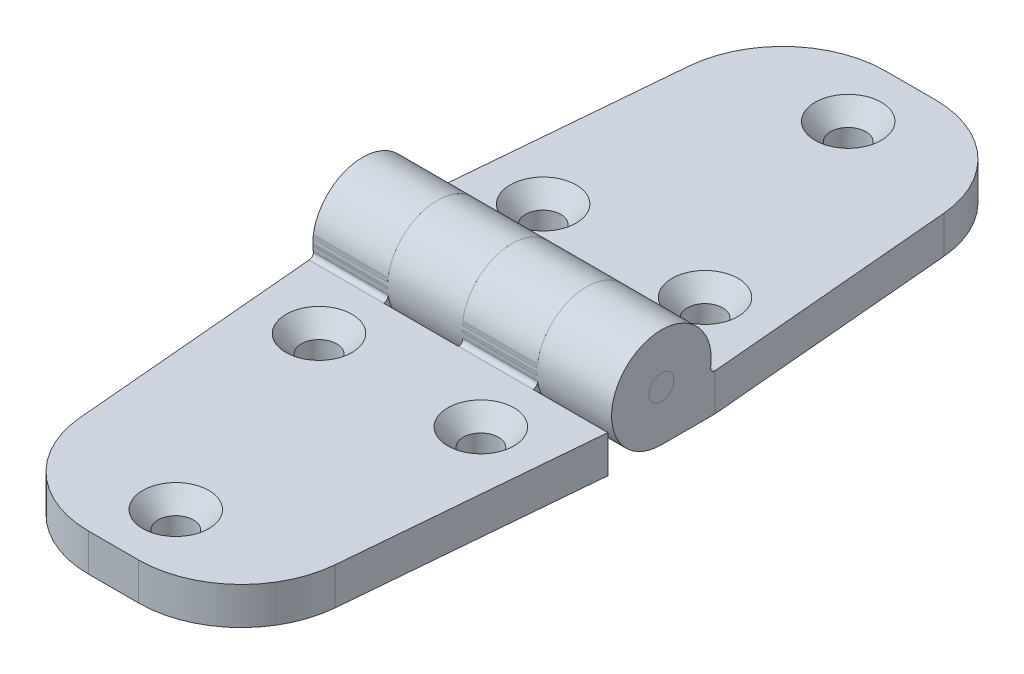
ISO-10303-21;
HEADER;
FILE_DESCRIPTION(('STEP AP214'),'2;1');
FILE_NAME('part.step','',(''),(''),'','','');
FILE_SCHEMA(('AUTOMOTIVE_DESIGN { 1 0 10303 214 1 1 1 1 }'));
ENDSEC;
DATA;
#1=APPLICATION_CONTEXT('core data for automotive mechanical design processes');
#2=APPLICATION_PROTOCOL_DEFINITION('international standard','automotive_design',2000,#1);
#3=PRODUCT_CONTEXT('',#1,'mechanical');
#4=PRODUCT('Part','Part','',(#3));
#5=PRODUCT_RELATED_PRODUCT_CATEGORY('part','',(#4));
#6=PRODUCT_DEFINITION_FORMATION('','',#4);
#7=PRODUCT_DEFINITION_CONTEXT('part definition',#1,'design');
#8=PRODUCT_DEFINITION('design','',#6,#7);
#9=PRODUCT_DEFINITION_SHAPE('','',#8);
#10=(LENGTH_UNIT() NAMED_UNIT(*) SI_UNIT(.MILLI.,.METRE.));
#11=(NAMED_UNIT(*) PLANE_ANGLE_UNIT() SI_UNIT($,.RADIAN.));
#12=(NAMED_UNIT(*) SI_UNIT($,.STERADIAN.) SOLID_ANGLE_UNIT());
#13=UNCERTAINTY_MEASURE_WITH_UNIT(LENGTH_MEASURE(1.E-05),#10,'distance_accuracy_value','');
#14=(GEOMETRIC_REPRESENTATION_CONTEXT(3) GLOBAL_UNCERTAINTY_ASSIGNED_CONTEXT((#13)) GLOBAL_UNIT_ASSIGNED_CONTEXT((#10,
#11,#12)) REPRESENTATION_CONTEXT('',''));
#15=CARTESIAN_POINT('',(0.,0.,0.));
#16=DIRECTION('',(0.,0.,1.));
#17=DIRECTION('',(1.,0.,0.));
#18=AXIS2_PLACEMENT_3D('',#15,#16,#17);
#19=CARTESIAN_POINT('',(19.05,6.35,-1.5875));
#20=DIRECTION('',(1.,0.,0.));
#21=DIRECTION('',(0.,0.,-1.));
#22=AXIS2_PLACEMENT_3D('',#19,#20,#21);
#23=PLANE('',#22);
#24=CARTESIAN_POINT('',(19.05,6.35,0.));
#25=DIRECTION('',(1.,0.,0.));
#26=DIRECTION('',(0.,0.,-1.));
#27=AXIS2_PLACEMENT_3D('',#24,#25,#26);
#28=CIRCLE('',#27,1.5875);
#29=CARTESIAN_POINT('',(19.05,6.35,-1.5875));
#30=VERTEX_POINT('',#29);
#31=EDGE_CURVE('E49',#30,#30,#28,.T.);
#32=ORIENTED_EDGE('',*,*,#31,.T.);
#33=EDGE_LOOP('',(#32));
#34=FACE_BOUND('',#33,.T.);
#35=ADVANCED_FACE('F43',(#34),#23,.T.);
#36=CARTESIAN_POINT('',(-19.05,6.35,-1.58749999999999));
#37=DIRECTION('',(-1.,0.,0.));
#38=DIRECTION('',(0.,0.,1.));
#39=AXIS2_PLACEMENT_3D('',#36,#37,#38);
#40=PLANE('',#39);
#41=CARTESIAN_POINT('',(-19.05,6.35,0.));
#42=DIRECTION('',(1.,0.,0.));
#43=DIRECTION('',(0.,0.,-1.));
#44=AXIS2_PLACEMENT_3D('',#41,#42,#43);
#45=CIRCLE('',#44,1.5875);
#46=CARTESIAN_POINT('',(-19.05,6.35,-1.58749999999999));
#47=VERTEX_POINT('',#46);
#48=EDGE_CURVE('E11',#47,#47,#45,.T.);
#49=ORIENTED_EDGE('',*,*,#48,.F.);
#50=EDGE_LOOP('',(#49));
#51=FACE_BOUND('',#50,.T.);
#52=ADVANCED_FACE('F58',(#51),#40,.T.);
#53=CARTESIAN_POINT('',(19.05,6.35,0.));
#54=DIRECTION('',(1.,0.,0.));
#55=DIRECTION('',(0.,0.,-1.));
#56=AXIS2_PLACEMENT_3D('',#53,#54,#55);
#57=CYLINDRICAL_SURFACE('',#56,1.5875);
#58=ORIENTED_EDGE('',*,*,#48,.T.);
#59=EDGE_LOOP('',(#58));
#60=FACE_BOUND('',#59,.T.);
#61=ORIENTED_EDGE('',*,*,#31,.F.);
#62=EDGE_LOOP('',(#61));
#63=FACE_BOUND('',#62,.T.);
#64=ADVANCED_FACE('F56',(#60,#63),#57,.T.);
#65=CLOSED_SHELL('',(#35,#52,#64));
#66=MANIFOLD_SOLID_BREP('B2',#65);
#67=CARTESIAN_POINT('',(77.5941073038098,0.,-50.8));
#68=DIRECTION('',(0.,0.,1.));
#69=DIRECTION('',(1.,0.,0.));
#70=AXIS2_PLACEMENT_3D('',#67,#68,#69);
#71=PLANE('',#70);
#72=DIRECTION('',(-1.,0.,0.));
#73=VECTOR('',#72,1.);
#74=CARTESIAN_POINT('',(77.5941073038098,4.76249999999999,-50.8));
#75=LINE('',#74,#73);
#76=CARTESIAN_POINT('',(3.175,4.76249999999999,-50.8));
#77=VERTEX_POINT('',#76);
#78=CARTESIAN_POINT('',(-3.175,4.76249999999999,-50.8));
#79=VERTEX_POINT('',#78);
#80=EDGE_CURVE('E278',#77,#79,#75,.T.);
#81=ORIENTED_EDGE('',*,*,#80,.F.);
#82=DIRECTION('',(0.,1.,0.));
#83=VECTOR('',#82,1.);
#84=CARTESIAN_POINT('',(3.175,-1051.3695,-50.8));
#85=LINE('',#84,#83);
#86=CARTESIAN_POINT('',(3.175,0.,-50.8));
#87=VERTEX_POINT('',#86);
#88=EDGE_CURVE('E41',#77,#87,#85,.F.);
#89=ORIENTED_EDGE('',*,*,#88,.T.);
#90=DIRECTION('',(-1.,0.,0.));
#91=VECTOR('',#90,1.);
#92=CARTESIAN_POINT('',(77.5941073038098,0.,-50.8));
#93=LINE('',#92,#91);
#94=CARTESIAN_POINT('',(-3.175,0.,-50.8));
#95=VERTEX_POINT('',#94);
#96=EDGE_CURVE('E281',#87,#95,#93,.T.);
#97=ORIENTED_EDGE('',*,*,#96,.T.);
#98=DIRECTION('',(0.,1.,0.));
#99=VECTOR('',#98,1.);
#100=CARTESIAN_POINT('',(-3.175,-1051.3695,-50.8));
#101=LINE('',#100,#99);
#102=EDGE_CURVE('E100',#79,#95,#101,.F.);
#103=ORIENTED_EDGE('',*,*,#102,.F.);
#104=EDGE_LOOP('',(#81,#89,#97,#103));
#105=FACE_BOUND('',#104,.T.);
#106=ADVANCED_FACE('F92',(#105),#71,.F.);
#107=CARTESIAN_POINT('',(77.5941073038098,5.31467391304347,-6.82408269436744));
#108=DIRECTION('',(-1.,0.,0.));
#109=DIRECTION('',(0.,0.,1.));
#110=AXIS2_PLACEMENT_3D('',#107,#108,#109);
#111=CYLINDRICAL_SURFACE('',#110,0.55217391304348);
#112=CARTESIAN_POINT('',(0.,5.31467391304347,-6.82408269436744));
#113=DIRECTION('',(1.,0.,0.));
#114=DIRECTION('',(0.,0.,-1.));
#115=AXIS2_PLACEMENT_3D('',#112,#113,#114);
#116=CIRCLE('',#115,0.55217391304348);
#117=CARTESIAN_POINT('',(0.,4.76249999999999,-6.82408269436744));
#118=VERTEX_POINT('',#117);
#119=CARTESIAN_POINT('',(0.,5.39749999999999,-6.27815607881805));
#120=VERTEX_POINT('',#119);
#121=EDGE_CURVE('E361',#118,#120,#116,.F.);
#122=ORIENTED_EDGE('',*,*,#121,.F.);
#123=DIRECTION('',(-1.,0.,0.));
#124=VECTOR('',#123,1.);
#125=CARTESIAN_POINT('',(77.5941073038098,4.76249999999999,-6.82408269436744));
#126=LINE('',#125,#124);
#127=CARTESIAN_POINT('',(-9.525,4.76249999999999,-6.82408269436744));
#128=VERTEX_POINT('',#127);
#129=EDGE_CURVE('E274',#118,#128,#126,.T.);
#130=ORIENTED_EDGE('',*,*,#129,.T.);
#131=CARTESIAN_POINT('',(-9.52500000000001,5.31467391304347,-6.82408269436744));
#132=DIRECTION('',(-1.,0.,0.));
#133=DIRECTION('',(0.,0.,1.));
#134=AXIS2_PLACEMENT_3D('',#131,#132,#133);
#135=CIRCLE('',#134,0.55217391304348);
#136=CARTESIAN_POINT('',(-9.52500000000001,5.39749999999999,-6.27815607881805));
#137=VERTEX_POINT('',#136);
#138=EDGE_CURVE('E254',#137,#128,#135,.F.);
#139=ORIENTED_EDGE('',*,*,#138,.F.);
#140=DIRECTION('',(-1.,0.,0.));
#141=VECTOR('',#140,1.);
#142=CARTESIAN_POINT('',(77.5941073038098,5.39749999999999,-6.27815607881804));
#143=LINE('',#142,#141);
#144=EDGE_CURVE('E270',#120,#137,#143,.T.);
#145=ORIENTED_EDGE('',*,*,#144,.F.);
#146=EDGE_LOOP('',(#122,#130,#139,#145));
#147=FACE_BOUND('',#146,.T.);
#148=ADVANCED_FACE('F405',(#147),#111,.F.);
#149=CARTESIAN_POINT('',(9.52500000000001,5.31467391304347,-6.82408269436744));
#150=DIRECTION('',(-1.,0.,0.));
#151=DIRECTION('',(0.,0.,1.));
#152=AXIS2_PLACEMENT_3D('',#149,#150,#151);
#153=CIRCLE('',#152,0.55217391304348);
#154=CARTESIAN_POINT('',(9.52500000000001,5.39749999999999,-6.27815607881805));
#155=VERTEX_POINT('',#154);
#156=CARTESIAN_POINT('',(9.52500000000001,4.76249999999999,-6.82408269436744));
#157=VERTEX_POINT('',#156);
#158=EDGE_CURVE('E302',#155,#157,#153,.F.);
#159=ORIENTED_EDGE('',*,*,#158,.F.);
#160=CARTESIAN_POINT('',(19.05,5.39749999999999,-6.27815607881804));
#161=VERTEX_POINT('',#160);
#162=EDGE_CURVE('E271',#161,#155,#143,.T.);
#163=ORIENTED_EDGE('',*,*,#162,.F.);
#164=CARTESIAN_POINT('',(19.05,5.31467391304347,-6.82408269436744));
#165=DIRECTION('',(1.,0.,0.));
#166=DIRECTION('',(0.,0.,-1.));
#167=AXIS2_PLACEMENT_3D('',#164,#165,#166);
#168=CIRCLE('',#167,0.55217391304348);
#169=CARTESIAN_POINT('',(19.05,4.76249999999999,-6.82408269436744));
#170=VERTEX_POINT('',#169);
#171=EDGE_CURVE('E261',#170,#161,#168,.F.);
#172=ORIENTED_EDGE('',*,*,#171,.F.);
#173=EDGE_CURVE('E275',#170,#157,#126,.T.);
#174=ORIENTED_EDGE('',*,*,#173,.T.);
#175=EDGE_LOOP('',(#159,#163,#172,#174));
#176=FACE_BOUND('',#175,.T.);
#177=ADVANCED_FACE('F410',(#176),#111,.F.);
#178=CARTESIAN_POINT('',(77.5941073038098,0.,0.));
#179=DIRECTION('',(0.,1.,0.));
#180=DIRECTION('',(0.,0.,1.));
#181=AXIS2_PLACEMENT_3D('',#178,#179,#180);
#182=PLANE('',#181);
#183=CARTESIAN_POINT('',(0.,0.,-42.8625));
#184=DIRECTION('',(0.,1.,0.));
#185=DIRECTION('',(0.,0.,1.));
#186=AXIS2_PLACEMENT_3D('',#183,#184,#185);
#187=CIRCLE('',#186,2.2479);
#188=CARTESIAN_POINT('',(0.,0.,-40.6146));
#189=VERTEX_POINT('',#188);
#190=EDGE_CURVE('E423',#189,#189,#187,.T.);
#191=ORIENTED_EDGE('',*,*,#190,.T.);
#192=EDGE_LOOP('',(#191));
#193=FACE_BOUND('',#192,.T.);
#194=CARTESIAN_POINT('',(-10.31875,0.,-14.2875));
#195=DIRECTION('',(0.,1.,0.));
#196=DIRECTION('',(0.,0.,1.));
#197=AXIS2_PLACEMENT_3D('',#194,#195,#196);
#198=CIRCLE('',#197,2.2479);
#199=CARTESIAN_POINT('',(-10.31875,0.,-12.0396));
#200=VERTEX_POINT('',#199);
#201=EDGE_CURVE('E427',#200,#200,#198,.T.);
#202=ORIENTED_EDGE('',*,*,#201,.T.);
#203=EDGE_LOOP('',(#202));
#204=FACE_BOUND('',#203,.T.);
#205=CARTESIAN_POINT('',(10.31875,0.,-14.2875));
#206=DIRECTION('',(0.,1.,0.));
#207=DIRECTION('',(0.,0.,1.));
#208=AXIS2_PLACEMENT_3D('',#205,#206,#207);
#209=CIRCLE('',#208,2.2479);
#210=CARTESIAN_POINT('',(10.31875,0.,-12.0396));
#211=VERTEX_POINT('',#210);
#212=EDGE_CURVE('E430',#211,#211,#209,.T.);
#213=ORIENTED_EDGE('',*,*,#212,.T.);
#214=EDGE_LOOP('',(#213));
#215=FACE_BOUND('',#214,.T.);
#216=CARTESIAN_POINT('',(3.175,0.,-37.6741715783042));
#217=DIRECTION('',(0.,1.,0.));
#218=DIRECTION('',(0.,0.,1.));
#219=AXIS2_PLACEMENT_3D('',#216,#217,#218);
#220=CIRCLE('',#219,13.1258284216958);
#221=CARTESIAN_POINT('',(16.2508806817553,0.,-38.8181629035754));
#222=VERTEX_POINT('',#221);
#223=EDGE_CURVE('E319',#87,#222,#220,.F.);
#224=ORIENTED_EDGE('',*,*,#223,.T.);
#225=DIRECTION('',(0.0871557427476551,0.,0.996194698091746));
#226=VECTOR('',#225,1.);
#227=CARTESIAN_POINT('',(20.0872030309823,0.,5.03120219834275));
#228=LINE('',#227,#226);
#229=CARTESIAN_POINT('',(19.05,0.,-6.82408269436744));
#230=VERTEX_POINT('',#229);
#231=EDGE_CURVE('E320',#222,#230,#228,.T.);
#232=ORIENTED_EDGE('',*,*,#231,.T.);
#233=DIRECTION('',(0.,0.,-1.));
#234=VECTOR('',#233,1.);
#235=CARTESIAN_POINT('',(19.05,0.,0.));
#236=LINE('',#235,#234);
#237=CARTESIAN_POINT('',(19.05,0.,0.));
#238=VERTEX_POINT('',#237);
#239=EDGE_CURVE('E264',#238,#230,#236,.T.);
#240=ORIENTED_EDGE('',*,*,#239,.F.);
#241=DIRECTION('',(-1.,0.,0.));
#242=VECTOR('',#241,1.);
#243=CARTESIAN_POINT('',(77.5941073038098,0.,0.));
#244=LINE('',#243,#242);
#245=CARTESIAN_POINT('',(9.52500000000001,0.,0.));
#246=VERTEX_POINT('',#245);
#247=EDGE_CURVE('E224',#238,#246,#244,.T.);
#248=ORIENTED_EDGE('',*,*,#247,.T.);
#249=DIRECTION('',(0.,0.,-1.));
#250=VECTOR('',#249,1.);
#251=CARTESIAN_POINT('',(9.525,0.,-6.82408269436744));
#252=LINE('',#251,#250);
#253=CARTESIAN_POINT('',(9.525,0.,-6.82408269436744));
#254=VERTEX_POINT('',#253);
#255=EDGE_CURVE('E107',#246,#254,#252,.T.);
#256=ORIENTED_EDGE('',*,*,#255,.T.);
#257=DIRECTION('',(-1.,0.,0.));
#258=VECTOR('',#257,1.);
#259=CARTESIAN_POINT('',(0.,0.,-6.82408269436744));
#260=LINE('',#259,#258);
#261=CARTESIAN_POINT('',(0.,0.,-6.82408269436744));
#262=VERTEX_POINT('',#261);
#263=EDGE_CURVE('E346',#254,#262,#260,.T.);
#264=ORIENTED_EDGE('',*,*,#263,.T.);
#265=DIRECTION('',(0.,0.,1.));
#266=VECTOR('',#265,1.);
#267=CARTESIAN_POINT('',(0.,0.,-6.82408269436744));
#268=LINE('',#267,#266);
#269=CARTESIAN_POINT('',(0.,0.,0.));
#270=VERTEX_POINT('',#269);
#271=EDGE_CURVE('E342',#262,#270,#268,.T.);
#272=ORIENTED_EDGE('',*,*,#271,.T.);
#273=CARTESIAN_POINT('',(-9.525,0.,0.));
#274=VERTEX_POINT('',#273);
#275=EDGE_CURVE('E284',#270,#274,#244,.T.);
#276=ORIENTED_EDGE('',*,*,#275,.T.);
#277=DIRECTION('',(0.,0.,-1.));
#278=VECTOR('',#277,1.);
#279=CARTESIAN_POINT('',(-9.525,0.,-6.82408269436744));
#280=LINE('',#279,#278);
#281=CARTESIAN_POINT('',(-9.525,0.,-6.82408269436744));
#282=VERTEX_POINT('',#281);
#283=EDGE_CURVE('E364',#274,#282,#280,.T.);
#284=ORIENTED_EDGE('',*,*,#283,.T.);
#285=DIRECTION('',(-1.,0.,0.));
#286=VECTOR('',#285,1.);
#287=CARTESIAN_POINT('',(-19.05,0.,-6.82408269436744));
#288=LINE('',#287,#286);
#289=CARTESIAN_POINT('',(-19.05,0.,-6.82408269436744));
#290=VERTEX_POINT('',#289);
#291=EDGE_CURVE('E367',#282,#290,#288,.T.);
#292=ORIENTED_EDGE('',*,*,#291,.T.);
#293=DIRECTION('',(0.0871557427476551,0.,-0.996194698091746));
#294=VECTOR('',#293,1.);
#295=CARTESIAN_POINT('',(-18.9083741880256,0.,-8.4428731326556));
#296=LINE('',#295,#294);
#297=CARTESIAN_POINT('',(-16.2508806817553,0.,-38.8181629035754));
#298=VERTEX_POINT('',#297);
#299=EDGE_CURVE('E218',#290,#298,#296,.T.);
#300=ORIENTED_EDGE('',*,*,#299,.T.);
#301=CARTESIAN_POINT('',(-3.175,0.,-37.6741715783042));
#302=DIRECTION('',(0.,1.,0.));
#303=DIRECTION('',(0.,0.,1.));
#304=AXIS2_PLACEMENT_3D('',#301,#302,#303);
#305=CIRCLE('',#304,13.1258284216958);
#306=EDGE_CURVE('E312',#298,#95,#305,.F.);
#307=ORIENTED_EDGE('',*,*,#306,.T.);
#308=ORIENTED_EDGE('',*,*,#96,.F.);
#309=EDGE_LOOP('',(#224,#232,#240,#248,#256,#264,#272,#276,#284,#292,#300,#307,#308));
#310=FACE_BOUND('',#309,.T.);
#311=ADVANCED_FACE('F318',(#193,#204,#215,#310),#182,.F.);
#312=CARTESIAN_POINT('',(77.5941073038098,6.35,0.));
#313=DIRECTION('',(-1.,0.,0.));
#314=DIRECTION('',(0.,0.,1.));
#315=AXIS2_PLACEMENT_3D('',#312,#313,#314);
#316=CYLINDRICAL_SURFACE('',#315,6.35);
#317=DIRECTION('',(-1.,0.,0.));
#318=VECTOR('',#317,1.);
#319=CARTESIAN_POINT('',(77.5941073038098,7.30249999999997,6.27815607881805));
#320=LINE('',#319,#318);
#321=CARTESIAN_POINT('',(0.,7.30249999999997,6.27815607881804));
#322=VERTEX_POINT('',#321);
#323=CARTESIAN_POINT('',(9.52500000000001,7.30250000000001,6.27815607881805));
#324=VERTEX_POINT('',#323);
#325=EDGE_CURVE('E304',#322,#324,#320,.F.);
#326=ORIENTED_EDGE('',*,*,#325,.F.);
#327=CARTESIAN_POINT('',(0.,6.35,0.));
#328=DIRECTION('',(1.,0.,0.));
#329=DIRECTION('',(0.,0.,-1.));
#330=AXIS2_PLACEMENT_3D('',#327,#328,#329);
#331=CIRCLE('',#330,6.35);
#332=EDGE_CURVE('E301',#120,#322,#331,.T.);
#333=ORIENTED_EDGE('',*,*,#332,.F.);
#334=ORIENTED_EDGE('',*,*,#144,.T.);
#335=CARTESIAN_POINT('',(-9.52500000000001,6.35,0.));
#336=DIRECTION('',(-1.,0.,0.));
#337=DIRECTION('',(0.,0.,1.));
#338=AXIS2_PLACEMENT_3D('',#335,#336,#337);
#339=CIRCLE('',#338,6.35);
#340=CARTESIAN_POINT('',(-9.525,7.30250000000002,6.27815607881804));
#341=VERTEX_POINT('',#340);
#342=EDGE_CURVE('E253',#341,#137,#339,.T.);
#343=ORIENTED_EDGE('',*,*,#342,.F.);
#344=DIRECTION('',(-1.,0.,0.));
#345=VECTOR('',#344,1.);
#346=CARTESIAN_POINT('',(77.5941073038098,7.30250000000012,6.27815607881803));
#347=LINE('',#346,#345);
#348=CARTESIAN_POINT('',(-19.05,7.30250000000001,6.27815607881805));
#349=VERTEX_POINT('',#348);
#350=EDGE_CURVE('E239',#349,#341,#347,.F.);
#351=ORIENTED_EDGE('',*,*,#350,.F.);
#352=CARTESIAN_POINT('',(-19.05,6.35,0.));
#353=DIRECTION('',(1.,0.,0.));
#354=DIRECTION('',(0.,0.,-1.));
#355=AXIS2_PLACEMENT_3D('',#352,#353,#354);
#356=CIRCLE('',#355,6.35);
#357=CARTESIAN_POINT('',(-19.05,5.39749999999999,6.27815607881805));
#358=VERTEX_POINT('',#357);
#359=EDGE_CURVE('E257',#358,#349,#356,.F.);
#360=ORIENTED_EDGE('',*,*,#359,.F.);
#361=DIRECTION('',(-1.,0.,0.));
#362=VECTOR('',#361,1.);
#363=CARTESIAN_POINT('',(77.5941073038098,5.39749999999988,6.27815607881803));
#364=LINE('',#363,#362);
#365=CARTESIAN_POINT('',(-9.525,5.39749999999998,6.27815607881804));
#366=VERTEX_POINT('',#365);
#367=EDGE_CURVE('E243',#366,#358,#364,.T.);
#368=ORIENTED_EDGE('',*,*,#367,.F.);
#369=EDGE_CURVE('E251',#274,#366,#339,.T.);
#370=ORIENTED_EDGE('',*,*,#369,.F.);
#371=ORIENTED_EDGE('',*,*,#275,.F.);
#372=CARTESIAN_POINT('',(0.,5.39750000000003,6.27815607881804));
#373=VERTEX_POINT('',#372);
#374=EDGE_CURVE('E362',#373,#270,#331,.T.);
#375=ORIENTED_EDGE('',*,*,#374,.F.);
#376=DIRECTION('',(-1.,0.,0.));
#377=VECTOR('',#376,1.);
#378=CARTESIAN_POINT('',(77.5941073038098,5.39750000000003,6.27815607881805));
#379=LINE('',#378,#377);
#380=CARTESIAN_POINT('',(9.52500000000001,5.39749999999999,6.27815607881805));
#381=VERTEX_POINT('',#380);
#382=EDGE_CURVE('E290',#381,#373,#379,.T.);
#383=ORIENTED_EDGE('',*,*,#382,.F.);
#384=CARTESIAN_POINT('',(9.52500000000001,6.35,0.));
#385=DIRECTION('',(-1.,0.,0.));
#386=DIRECTION('',(0.,0.,1.));
#387=AXIS2_PLACEMENT_3D('',#384,#385,#386);
#388=CIRCLE('',#387,6.35);
#389=EDGE_CURVE('E296',#246,#381,#388,.T.);
#390=ORIENTED_EDGE('',*,*,#389,.F.);
#391=ORIENTED_EDGE('',*,*,#247,.F.);
#392=CARTESIAN_POINT('',(19.05,6.35,0.));
#393=DIRECTION('',(1.,0.,0.));
#394=DIRECTION('',(0.,0.,-1.));
#395=AXIS2_PLACEMENT_3D('',#392,#393,#394);
#396=CIRCLE('',#395,6.35);
#397=EDGE_CURVE('E267',#161,#238,#396,.T.);
#398=ORIENTED_EDGE('',*,*,#397,.F.);
#399=ORIENTED_EDGE('',*,*,#162,.T.);
#400=EDGE_CURVE('E358',#324,#155,#388,.T.);
#401=ORIENTED_EDGE('',*,*,#400,.F.);
#402=EDGE_LOOP('',(#326,#333,#334,#343,#351,#360,#368,#370,#371,#375,#383,#390,#391,#398,#399,#401));
#403=FACE_BOUND('',#402,.T.);
#404=ADVANCED_FACE('F94',(#403),#316,.T.);
#405=CARTESIAN_POINT('',(77.5941073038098,6.35,0.));
#406=DIRECTION('',(-1.,0.,0.));
#407=DIRECTION('',(0.,0.,1.));
#408=AXIS2_PLACEMENT_3D('',#405,#406,#407);
#409=CYLINDRICAL_SURFACE('',#408,1.5875);
#410=CARTESIAN_POINT('',(-9.52500000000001,6.35,0.));
#411=DIRECTION('',(-1.,0.,0.));
#412=DIRECTION('',(0.,0.,1.));
#413=AXIS2_PLACEMENT_3D('',#410,#411,#412);
#414=CIRCLE('',#413,1.5875);
#415=CARTESIAN_POINT('',(-9.52500000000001,6.35,1.5875));
#416=VERTEX_POINT('',#415);
#417=EDGE_CURVE('E250',#416,#416,#414,.T.);
#418=ORIENTED_EDGE('',*,*,#417,.T.);
#419=EDGE_LOOP('',(#418));
#420=FACE_BOUND('',#419,.T.);
#421=CARTESIAN_POINT('',(0.,6.35,0.));
#422=DIRECTION('',(1.,0.,0.));
#423=DIRECTION('',(0.,0.,-1.));
#424=AXIS2_PLACEMENT_3D('',#421,#422,#423);
#425=CIRCLE('',#424,1.5875);
#426=CARTESIAN_POINT('',(0.,6.35,-1.5875));
#427=VERTEX_POINT('',#426);
#428=EDGE_CURVE('E298',#427,#427,#425,.T.);
#429=ORIENTED_EDGE('',*,*,#428,.T.);
#430=EDGE_LOOP('',(#429));
#431=FACE_BOUND('',#430,.T.);
#432=ADVANCED_FACE('F399',(#420,#431),#409,.F.);
#433=CARTESIAN_POINT('',(19.05,6.35,0.));
#434=DIRECTION('',(1.,0.,0.));
#435=DIRECTION('',(0.,0.,-1.));
#436=AXIS2_PLACEMENT_3D('',#433,#434,#435);
#437=CIRCLE('',#436,1.5875);
#438=CARTESIAN_POINT('',(19.05,6.35,-1.5875));
#439=VERTEX_POINT('',#438);
#440=EDGE_CURVE('E260',#439,#439,#437,.T.);
#441=ORIENTED_EDGE('',*,*,#440,.T.);
#442=EDGE_LOOP('',(#441));
#443=FACE_BOUND('',#442,.T.);
#444=CARTESIAN_POINT('',(9.52500000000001,6.35,0.));
#445=DIRECTION('',(-1.,0.,0.));
#446=DIRECTION('',(0.,0.,1.));
#447=AXIS2_PLACEMENT_3D('',#444,#445,#446);
#448=CIRCLE('',#447,1.5875);
#449=CARTESIAN_POINT('',(9.52500000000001,6.35,1.5875));
#450=VERTEX_POINT('',#449);
#451=EDGE_CURVE('E293',#450,#450,#448,.T.);
#452=ORIENTED_EDGE('',*,*,#451,.T.);
#453=EDGE_LOOP('',(#452));
#454=FACE_BOUND('',#453,.T.);
#455=ADVANCED_FACE('F390',(#443,#454),#409,.F.);
#456=CARTESIAN_POINT('',(-19.05,6.35,0.));
#457=DIRECTION('',(1.,0.,0.));
#458=DIRECTION('',(0.,0.,-1.));
#459=AXIS2_PLACEMENT_3D('',#456,#457,#458);
#460=PLANE('',#459);
#461=DIRECTION('',(0.,1.,0.));
#462=VECTOR('',#461,1.);
#463=CARTESIAN_POINT('',(-19.05,6.35,6.27815607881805));
#464=LINE('',#463,#462);
#465=EDGE_CURVE('E223',#358,#349,#464,.T.);
#466=ORIENTED_EDGE('',*,*,#465,.F.);
#467=ORIENTED_EDGE('',*,*,#359,.T.);
#468=EDGE_LOOP('',(#466,#467));
#469=FACE_BOUND('',#468,.T.);
#470=ADVANCED_FACE('F388',(#469),#460,.F.);
#471=CARTESIAN_POINT('',(77.5941073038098,4.76249999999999,-50.8));
#472=DIRECTION('',(0.,-1.,0.));
#473=DIRECTION('',(0.,0.,-1.));
#474=AXIS2_PLACEMENT_3D('',#471,#472,#473);
#475=PLANE('',#474);
#476=CARTESIAN_POINT('',(0.,4.7625,-42.8625));
#477=DIRECTION('',(0.,1.,0.));
#478=DIRECTION('',(0.,0.,1.));
#479=AXIS2_PLACEMENT_3D('',#476,#477,#478);
#480=CIRCLE('',#479,4.2164);
#481=CARTESIAN_POINT('',(0.,4.7625,-38.6461));
#482=VERTEX_POINT('',#481);
#483=EDGE_CURVE('E600',#482,#482,#480,.T.);
#484=ORIENTED_EDGE('',*,*,#483,.F.);
#485=EDGE_LOOP('',(#484));
#486=FACE_BOUND('',#485,.T.);
#487=CARTESIAN_POINT('',(-10.31875,4.7625,-14.2875));
#488=DIRECTION('',(0.,1.,0.));
#489=DIRECTION('',(0.,0.,1.));
#490=AXIS2_PLACEMENT_3D('',#487,#488,#489);
#491=CIRCLE('',#490,4.2164);
#492=CARTESIAN_POINT('',(-10.31875,4.7625,-10.0711));
#493=VERTEX_POINT('',#492);
#494=EDGE_CURVE('E433',#493,#493,#491,.T.);
#495=ORIENTED_EDGE('',*,*,#494,.F.);
#496=EDGE_LOOP('',(#495));
#497=FACE_BOUND('',#496,.T.);
#498=CARTESIAN_POINT('',(10.31875,4.7625,-14.2875));
#499=DIRECTION('',(0.,1.,0.));
#500=DIRECTION('',(0.,0.,1.));
#501=AXIS2_PLACEMENT_3D('',#498,#499,#500);
#502=CIRCLE('',#501,4.2164);
#503=CARTESIAN_POINT('',(10.31875,4.7625,-10.0711));
#504=VERTEX_POINT('',#503);
#505=EDGE_CURVE('E234',#504,#504,#502,.T.);
#506=ORIENTED_EDGE('',*,*,#505,.F.);
#507=EDGE_LOOP('',(#506));
#508=FACE_BOUND('',#507,.T.);
#509=ORIENTED_EDGE('',*,*,#173,.F.);
#510=DIRECTION('',(0.087155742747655,0.,0.996194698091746));
#511=VECTOR('',#510,1.);
#512=CARTESIAN_POINT('',(19.05,4.76249999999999,-6.82408269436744));
#513=LINE('',#512,#511);
#514=CARTESIAN_POINT('',(16.2508806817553,4.76249999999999,-38.8181629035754));
#515=VERTEX_POINT('',#514);
#516=EDGE_CURVE('E329',#515,#170,#513,.T.);
#517=ORIENTED_EDGE('',*,*,#516,.F.);
#518=CARTESIAN_POINT('',(3.175,4.76249999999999,-37.6741715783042));
#519=DIRECTION('',(0.,-1.,0.));
#520=DIRECTION('',(0.,0.,-1.));
#521=AXIS2_PLACEMENT_3D('',#518,#519,#520);
#522=CIRCLE('',#521,13.1258284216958);
#523=EDGE_CURVE('E327',#77,#515,#522,.T.);
#524=ORIENTED_EDGE('',*,*,#523,.F.);
#525=ORIENTED_EDGE('',*,*,#80,.T.);
#526=CARTESIAN_POINT('',(-3.175,4.76249999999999,-37.6741715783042));
#527=DIRECTION('',(0.,-1.,0.));
#528=DIRECTION('',(0.,0.,1.));
#529=AXIS2_PLACEMENT_3D('',#526,#527,#528);
#530=CIRCLE('',#529,13.1258284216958);
#531=CARTESIAN_POINT('',(-16.2508806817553,4.76249999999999,-38.8181629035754));
#532=VERTEX_POINT('',#531);
#533=EDGE_CURVE('E233',#532,#79,#530,.T.);
#534=ORIENTED_EDGE('',*,*,#533,.F.);
#535=DIRECTION('',(0.087155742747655,0.,-0.996194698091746));
#536=VECTOR('',#535,1.);
#537=CARTESIAN_POINT('',(-19.05,4.76249999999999,-6.82408269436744));
#538=LINE('',#537,#536);
#539=CARTESIAN_POINT('',(-19.05,4.76249999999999,-6.82408269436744));
#540=VERTEX_POINT('',#539);
#541=EDGE_CURVE('E215',#540,#532,#538,.T.);
#542=ORIENTED_EDGE('',*,*,#541,.F.);
#543=DIRECTION('',(-1.,0.,0.));
#544=VECTOR('',#543,1.);
#545=CARTESIAN_POINT('',(77.5941073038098,4.76249999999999,-6.82408269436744));
#546=LINE('',#545,#544);
#547=EDGE_CURVE('E231',#128,#540,#546,.T.);
#548=ORIENTED_EDGE('',*,*,#547,.F.);
#549=ORIENTED_EDGE('',*,*,#129,.F.);
#550=EDGE_CURVE('E279',#157,#118,#126,.T.);
#551=ORIENTED_EDGE('',*,*,#550,.F.);
#552=EDGE_LOOP('',(#509,#517,#524,#525,#534,#542,#548,#549,#551));
#553=FACE_BOUND('',#552,.T.);
#554=ADVANCED_FACE('F229',(#486,#497,#508,#553),#475,.F.);
#555=CARTESIAN_POINT('',(19.05,6.35,0.));
#556=DIRECTION('',(1.,0.,0.));
#557=DIRECTION('',(0.,0.,-1.));
#558=AXIS2_PLACEMENT_3D('',#555,#556,#557);
#559=PLANE('',#558);
#560=DIRECTION('',(0.,-1.,0.));
#561=VECTOR('',#560,1.);
#562=CARTESIAN_POINT('',(19.05,6.35,-6.82408269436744));
#563=LINE('',#562,#561);
#564=EDGE_CURVE('E307',#170,#230,#563,.T.);
#565=ORIENTED_EDGE('',*,*,#564,.F.);
#566=ORIENTED_EDGE('',*,*,#171,.T.);
#567=ORIENTED_EDGE('',*,*,#397,.T.);
#568=ORIENTED_EDGE('',*,*,#239,.T.);
#569=EDGE_LOOP('',(#565,#566,#567,#568));
#570=FACE_BOUND('',#569,.T.);
#571=ORIENTED_EDGE('',*,*,#440,.F.);
#572=EDGE_LOOP('',(#571));
#573=FACE_BOUND('',#572,.T.);
#574=ADVANCED_FACE('F396',(#570,#573),#559,.T.);
#575=CARTESIAN_POINT('',(-9.525,12.7,-6.82408269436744));
#576=DIRECTION('',(-1.,0.,0.));
#577=DIRECTION('',(0.,0.,1.));
#578=AXIS2_PLACEMENT_3D('',#575,#576,#577);
#579=PLANE('',#578);
#580=ORIENTED_EDGE('',*,*,#417,.F.);
#581=EDGE_LOOP('',(#580));
#582=FACE_BOUND('',#581,.T.);
#583=ORIENTED_EDGE('',*,*,#138,.T.);
#584=DIRECTION('',(0.,-1.,0.));
#585=VECTOR('',#584,1.);
#586=CARTESIAN_POINT('',(-9.525,12.7,-6.82408269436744));
#587=LINE('',#586,#585);
#588=EDGE_CURVE('E238',#128,#282,#587,.T.);
#589=ORIENTED_EDGE('',*,*,#588,.T.);
#590=ORIENTED_EDGE('',*,*,#283,.F.);
#591=ORIENTED_EDGE('',*,*,#369,.T.);
#592=DIRECTION('',(0.,-1.,0.));
#593=VECTOR('',#592,1.);
#594=CARTESIAN_POINT('',(-9.525,12.7,6.27815607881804));
#595=LINE('',#594,#593);
#596=EDGE_CURVE('E240',#341,#366,#595,.T.);
#597=ORIENTED_EDGE('',*,*,#596,.F.);
#598=ORIENTED_EDGE('',*,*,#342,.T.);
#599=EDGE_LOOP('',(#583,#589,#590,#591,#597,#598));
#600=FACE_BOUND('',#599,.T.);
#601=ADVANCED_FACE('F370',(#582,#600),#579,.T.);
#602=CARTESIAN_POINT('',(-19.05,12.7,6.27815607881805));
#603=DIRECTION('',(0.,0.,-1.));
#604=DIRECTION('',(-1.,0.,0.));
#605=AXIS2_PLACEMENT_3D('',#602,#603,#604);
#606=PLANE('',#605);
#607=ORIENTED_EDGE('',*,*,#367,.T.);
#608=ORIENTED_EDGE('',*,*,#465,.T.);
#609=ORIENTED_EDGE('',*,*,#350,.T.);
#610=ORIENTED_EDGE('',*,*,#596,.T.);
#611=EDGE_LOOP('',(#607,#608,#609,#610));
#612=FACE_BOUND('',#611,.T.);
#613=ADVANCED_FACE('F384',(#612),#606,.T.);
#614=CARTESIAN_POINT('',(-19.05,12.7,-6.82408269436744));
#615=DIRECTION('',(0.,0.,1.));
#616=DIRECTION('',(1.,0.,0.));
#617=AXIS2_PLACEMENT_3D('',#614,#615,#616);
#618=PLANE('',#617);
#619=ORIENTED_EDGE('',*,*,#547,.T.);
#620=DIRECTION('',(0.,-1.,0.));
#621=VECTOR('',#620,1.);
#622=CARTESIAN_POINT('',(-19.05,6.35,-6.82408269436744));
#623=LINE('',#622,#621);
#624=EDGE_CURVE('E211',#540,#290,#623,.T.);
#625=ORIENTED_EDGE('',*,*,#624,.T.);
#626=ORIENTED_EDGE('',*,*,#291,.F.);
#627=ORIENTED_EDGE('',*,*,#588,.F.);
#628=EDGE_LOOP('',(#619,#625,#626,#627));
#629=FACE_BOUND('',#628,.T.);
#630=ADVANCED_FACE('F237',(#629),#618,.T.);
#631=CARTESIAN_POINT('',(0.,12.7,6.27815607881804));
#632=DIRECTION('',(0.,0.,-1.));
#633=DIRECTION('',(-1.,0.,0.));
#634=AXIS2_PLACEMENT_3D('',#631,#632,#633);
#635=PLANE('',#634);
#636=ORIENTED_EDGE('',*,*,#382,.T.);
#637=DIRECTION('',(0.,-1.,0.));
#638=VECTOR('',#637,1.);
#639=CARTESIAN_POINT('',(0.,12.7,6.27815607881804));
#640=LINE('',#639,#638);
#641=EDGE_CURVE('E297',#322,#373,#640,.T.);
#642=ORIENTED_EDGE('',*,*,#641,.F.);
#643=ORIENTED_EDGE('',*,*,#325,.T.);
#644=DIRECTION('',(0.,-1.,0.));
#645=VECTOR('',#644,1.);
#646=CARTESIAN_POINT('',(9.525,12.7,6.27815607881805));
#647=LINE('',#646,#645);
#648=EDGE_CURVE('E352',#324,#381,#647,.T.);
#649=ORIENTED_EDGE('',*,*,#648,.T.);
#650=EDGE_LOOP('',(#636,#642,#643,#649));
#651=FACE_BOUND('',#650,.T.);
#652=ADVANCED_FACE('F477',(#651),#635,.T.);
#653=CARTESIAN_POINT('',(0.,12.7,-6.82408269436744));
#654=DIRECTION('',(1.,0.,0.));
#655=DIRECTION('',(0.,0.,-1.));
#656=AXIS2_PLACEMENT_3D('',#653,#654,#655);
#657=PLANE('',#656);
#658=ORIENTED_EDGE('',*,*,#428,.F.);
#659=EDGE_LOOP('',(#658));
#660=FACE_BOUND('',#659,.T.);
#661=ORIENTED_EDGE('',*,*,#374,.T.);
#662=ORIENTED_EDGE('',*,*,#271,.F.);
#663=DIRECTION('',(0.,-1.,0.));
#664=VECTOR('',#663,1.);
#665=CARTESIAN_POINT('',(0.,12.7,-6.82408269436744));
#666=LINE('',#665,#664);
#667=EDGE_CURVE('E349',#118,#262,#666,.T.);
#668=ORIENTED_EDGE('',*,*,#667,.F.);
#669=ORIENTED_EDGE('',*,*,#121,.T.);
#670=ORIENTED_EDGE('',*,*,#332,.T.);
#671=ORIENTED_EDGE('',*,*,#641,.T.);
#672=EDGE_LOOP('',(#661,#662,#668,#669,#670,#671));
#673=FACE_BOUND('',#672,.T.);
#674=ADVANCED_FACE('F475',(#660,#673),#657,.T.);
#675=CARTESIAN_POINT('',(9.525,12.7,-6.82408269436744));
#676=DIRECTION('',(-1.,0.,0.));
#677=DIRECTION('',(0.,0.,1.));
#678=AXIS2_PLACEMENT_3D('',#675,#676,#677);
#679=PLANE('',#678);
#680=ORIENTED_EDGE('',*,*,#451,.F.);
#681=EDGE_LOOP('',(#680));
#682=FACE_BOUND('',#681,.T.);
#683=ORIENTED_EDGE('',*,*,#158,.T.);
#684=DIRECTION('',(0.,-1.,0.));
#685=VECTOR('',#684,1.);
#686=CARTESIAN_POINT('',(9.525,12.7,-6.82408269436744));
#687=LINE('',#686,#685);
#688=EDGE_CURVE('E114',#157,#254,#687,.T.);
#689=ORIENTED_EDGE('',*,*,#688,.T.);
#690=ORIENTED_EDGE('',*,*,#255,.F.);
#691=ORIENTED_EDGE('',*,*,#389,.T.);
#692=ORIENTED_EDGE('',*,*,#648,.F.);
#693=ORIENTED_EDGE('',*,*,#400,.T.);
#694=EDGE_LOOP('',(#683,#689,#690,#691,#692,#693));
#695=FACE_BOUND('',#694,.T.);
#696=ADVANCED_FACE('F472',(#682,#695),#679,.T.);
#697=CARTESIAN_POINT('',(0.,12.7,-6.82408269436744));
#698=DIRECTION('',(0.,0.,1.));
#699=DIRECTION('',(1.,0.,0.));
#700=AXIS2_PLACEMENT_3D('',#697,#698,#699);
#701=PLANE('',#700);
#702=ORIENTED_EDGE('',*,*,#550,.T.);
#703=ORIENTED_EDGE('',*,*,#667,.T.);
#704=ORIENTED_EDGE('',*,*,#263,.F.);
#705=ORIENTED_EDGE('',*,*,#688,.F.);
#706=EDGE_LOOP('',(#702,#703,#704,#705));
#707=FACE_BOUND('',#706,.T.);
#708=ADVANCED_FACE('F469',(#707),#701,.T.);
#709=CARTESIAN_POINT('',(-19.05,-1051.3695,-6.82408269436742));
#710=DIRECTION('',(0.996194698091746,0.,0.087155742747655));
#711=DIRECTION('',(0.0871557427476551,0.,-0.996194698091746));
#712=AXIS2_PLACEMENT_3D('',#709,#710,#711);
#713=PLANE('',#712);
#714=ORIENTED_EDGE('',*,*,#624,.F.);
#715=ORIENTED_EDGE('',*,*,#541,.T.);
#716=DIRECTION('',(0.,1.,0.));
#717=VECTOR('',#716,1.);
#718=CARTESIAN_POINT('',(-16.2508806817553,-1051.3695,-38.8181629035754));
#719=LINE('',#718,#717);
#720=EDGE_CURVE('E331',#298,#532,#719,.T.);
#721=ORIENTED_EDGE('',*,*,#720,.F.);
#722=ORIENTED_EDGE('',*,*,#299,.F.);
#723=EDGE_LOOP('',(#714,#715,#721,#722));
#724=FACE_BOUND('',#723,.T.);
#725=ADVANCED_FACE('F213',(#724),#713,.F.);
#726=CARTESIAN_POINT('',(-3.175,-1051.3695,-37.6741715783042));
#727=DIRECTION('',(0.,1.,0.));
#728=DIRECTION('',(0.,0.,1.));
#729=AXIS2_PLACEMENT_3D('',#726,#727,#728);
#730=CYLINDRICAL_SURFACE('',#729,13.1258284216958);
#731=ORIENTED_EDGE('',*,*,#720,.T.);
#732=ORIENTED_EDGE('',*,*,#533,.T.);
#733=ORIENTED_EDGE('',*,*,#102,.T.);
#734=ORIENTED_EDGE('',*,*,#306,.F.);
#735=EDGE_LOOP('',(#731,#732,#733,#734));
#736=FACE_BOUND('',#735,.T.);
#737=ADVANCED_FACE('F311',(#736),#730,.T.);
#738=CARTESIAN_POINT('',(3.175,-1051.3695,-37.6741715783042));
#739=DIRECTION('',(0.,1.,0.));
#740=DIRECTION('',(0.,0.,1.));
#741=AXIS2_PLACEMENT_3D('',#738,#739,#740);
#742=CYLINDRICAL_SURFACE('',#741,13.1258284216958);
#743=ORIENTED_EDGE('',*,*,#88,.F.);
#744=ORIENTED_EDGE('',*,*,#523,.T.);
#745=DIRECTION('',(0.,1.,0.));
#746=VECTOR('',#745,1.);
#747=CARTESIAN_POINT('',(16.2508806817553,-1051.3695,-38.8181629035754));
#748=LINE('',#747,#746);
#749=EDGE_CURVE('E335',#222,#515,#748,.T.);
#750=ORIENTED_EDGE('',*,*,#749,.F.);
#751=ORIENTED_EDGE('',*,*,#223,.F.);
#752=EDGE_LOOP('',(#743,#744,#750,#751));
#753=FACE_BOUND('',#752,.T.);
#754=ADVANCED_FACE('F325',(#753),#742,.T.);
#755=CARTESIAN_POINT('',(19.05,-1051.3695,-6.82408269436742));
#756=DIRECTION('',(-0.996194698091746,0.,0.087155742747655));
#757=DIRECTION('',(0.0871557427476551,0.,0.996194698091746));
#758=AXIS2_PLACEMENT_3D('',#755,#756,#757);
#759=PLANE('',#758);
#760=ORIENTED_EDGE('',*,*,#749,.T.);
#761=ORIENTED_EDGE('',*,*,#516,.T.);
#762=ORIENTED_EDGE('',*,*,#564,.T.);
#763=ORIENTED_EDGE('',*,*,#231,.F.);
#764=EDGE_LOOP('',(#760,#761,#762,#763));
#765=FACE_BOUND('',#764,.T.);
#766=ADVANCED_FACE('F449',(#765),#759,.F.);
#767=CARTESIAN_POINT('',(10.31875,4.7625,-14.2875));
#768=DIRECTION('',(0.,1.,0.));
#769=DIRECTION('',(0.,0.,1.));
#770=AXIS2_PLACEMENT_3D('',#767,#768,#769);
#771=CONICAL_SURFACE('',#770,4.2164,0.715584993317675);
#772=CARTESIAN_POINT('',(10.31875,2.49799979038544,-14.2875));
#773=DIRECTION('',(0.,1.,0.));
#774=DIRECTION('',(0.,0.,1.));
#775=AXIS2_PLACEMENT_3D('',#772,#773,#774);
#776=CIRCLE('',#775,2.2479);
#777=CARTESIAN_POINT('',(10.31875,2.49799979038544,-12.0396));
#778=VERTEX_POINT('',#777);
#779=EDGE_CURVE('E432',#778,#778,#776,.T.);
#780=ORIENTED_EDGE('',*,*,#779,.F.);
#781=EDGE_LOOP('',(#780));
#782=FACE_BOUND('',#781,.T.);
#783=ORIENTED_EDGE('',*,*,#505,.T.);
#784=EDGE_LOOP('',(#783));
#785=FACE_BOUND('',#784,.T.);
#786=ADVANCED_FACE('F445',(#782,#785),#771,.F.);
#787=CARTESIAN_POINT('',(10.31875,4.7625,-14.2875));
#788=DIRECTION('',(0.,1.,0.));
#789=DIRECTION('',(0.,0.,1.));
#790=AXIS2_PLACEMENT_3D('',#787,#788,#789);
#791=CYLINDRICAL_SURFACE('',#790,2.2479);
#792=ORIENTED_EDGE('',*,*,#212,.F.);
#793=EDGE_LOOP('',(#792));
#794=FACE_BOUND('',#793,.T.);
#795=ORIENTED_EDGE('',*,*,#779,.T.);
#796=EDGE_LOOP('',(#795));
#797=FACE_BOUND('',#796,.T.);
#798=ADVANCED_FACE('F448',(#794,#797),#791,.F.);
#799=CARTESIAN_POINT('',(-10.31875,4.7625,-14.2875));
#800=DIRECTION('',(0.,1.,0.));
#801=DIRECTION('',(0.,0.,1.));
#802=AXIS2_PLACEMENT_3D('',#799,#800,#801);
#803=CONICAL_SURFACE('',#802,4.2164,0.715584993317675);
#804=CARTESIAN_POINT('',(-10.31875,2.49799979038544,-14.2875));
#805=DIRECTION('',(0.,1.,0.));
#806=DIRECTION('',(0.,0.,1.));
#807=AXIS2_PLACEMENT_3D('',#804,#805,#806);
#808=CIRCLE('',#807,2.2479);
#809=CARTESIAN_POINT('',(-10.31875,2.49799979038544,-12.0396));
#810=VERTEX_POINT('',#809);
#811=EDGE_CURVE('E438',#810,#810,#808,.T.);
#812=ORIENTED_EDGE('',*,*,#811,.F.);
#813=EDGE_LOOP('',(#812));
#814=FACE_BOUND('',#813,.T.);
#815=ORIENTED_EDGE('',*,*,#494,.T.);
#816=EDGE_LOOP('',(#815));
#817=FACE_BOUND('',#816,.T.);
#818=ADVANCED_FACE('F456',(#814,#817),#803,.F.);
#819=CARTESIAN_POINT('',(-10.31875,4.7625,-14.2875));
#820=DIRECTION('',(0.,1.,0.));
#821=DIRECTION('',(0.,0.,1.));
#822=AXIS2_PLACEMENT_3D('',#819,#820,#821);
#823=CYLINDRICAL_SURFACE('',#822,2.2479);
#824=ORIENTED_EDGE('',*,*,#201,.F.);
#825=EDGE_LOOP('',(#824));
#826=FACE_BOUND('',#825,.T.);
#827=ORIENTED_EDGE('',*,*,#811,.T.);
#828=EDGE_LOOP('',(#827));
#829=FACE_BOUND('',#828,.T.);
#830=ADVANCED_FACE('F563',(#826,#829),#823,.F.);
#831=CARTESIAN_POINT('',(0.,4.7625,-42.8625));
#832=DIRECTION('',(0.,1.,0.));
#833=DIRECTION('',(0.,0.,1.));
#834=AXIS2_PLACEMENT_3D('',#831,#832,#833);
#835=CONICAL_SURFACE('',#834,4.2164,0.715584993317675);
#836=CARTESIAN_POINT('',(0.,2.49799979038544,-42.8625));
#837=DIRECTION('',(0.,1.,0.));
#838=DIRECTION('',(0.,0.,1.));
#839=AXIS2_PLACEMENT_3D('',#836,#837,#838);
#840=CIRCLE('',#839,2.2479);
#841=CARTESIAN_POINT('',(0.,2.49799979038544,-40.6146));
#842=VERTEX_POINT('',#841);
#843=EDGE_CURVE('E599',#842,#842,#840,.T.);
#844=ORIENTED_EDGE('',*,*,#843,.F.);
#845=EDGE_LOOP('',(#844));
#846=FACE_BOUND('',#845,.T.);
#847=ORIENTED_EDGE('',*,*,#483,.T.);
#848=EDGE_LOOP('',(#847));
#849=FACE_BOUND('',#848,.T.);
#850=ADVANCED_FACE('F572',(#846,#849),#835,.F.);
#851=CARTESIAN_POINT('',(0.,4.7625,-42.8625));
#852=DIRECTION('',(0.,1.,0.));
#853=DIRECTION('',(0.,0.,1.));
#854=AXIS2_PLACEMENT_3D('',#851,#852,#853);
#855=CYLINDRICAL_SURFACE('',#854,2.2479);
#856=ORIENTED_EDGE('',*,*,#190,.F.);
#857=EDGE_LOOP('',(#856));
#858=FACE_BOUND('',#857,.T.);
#859=ORIENTED_EDGE('',*,*,#843,.T.);
#860=EDGE_LOOP('',(#859));
#861=FACE_BOUND('',#860,.T.);
#862=ADVANCED_FACE('F582',(#858,#861),#855,.F.);
#863=CLOSED_SHELL('',(#106,#148,#177,#311,#404,#432,#455,#470,#554,#574,#601,#613,#630,#652,
#674,#696,#708,#725,#737,#754,#766,#786,#798,#818,#830,#850,#862));
#864=MANIFOLD_SOLID_BREP('B6',#863);
#865=CARTESIAN_POINT('',(19.05,0.,50.8));
#866=DIRECTION('',(0.,0.,-1.));
#867=DIRECTION('',(-1.,0.,0.));
#868=AXIS2_PLACEMENT_3D('',#865,#866,#867);
#869=PLANE('',#868);
#870=DIRECTION('',(-1.,0.,0.));
#871=VECTOR('',#870,1.);
#872=CARTESIAN_POINT('',(19.05,4.76249999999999,50.8));
#873=LINE('',#872,#871);
#874=CARTESIAN_POINT('',(3.17500000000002,4.76249999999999,50.8));
#875=VERTEX_POINT('',#874);
#876=CARTESIAN_POINT('',(-3.17499999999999,4.76249999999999,50.8));
#877=VERTEX_POINT('',#876);
#878=EDGE_CURVE('E898',#875,#877,#873,.T.);
#879=ORIENTED_EDGE('',*,*,#878,.T.);
#880=DIRECTION('',(0.,1.,0.));
#881=VECTOR('',#880,1.);
#882=CARTESIAN_POINT('',(-3.17499999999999,-1051.3695,50.8));
#883=LINE('',#882,#881);
#884=CARTESIAN_POINT('',(-3.17499999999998,0.,50.8));
#885=VERTEX_POINT('',#884);
#886=EDGE_CURVE('E90',#877,#885,#883,.F.);
#887=ORIENTED_EDGE('',*,*,#886,.T.);
#888=DIRECTION('',(-1.,0.,0.));
#889=VECTOR('',#888,1.);
#890=CARTESIAN_POINT('',(19.05,0.,50.8));
#891=LINE('',#890,#889);
#892=CARTESIAN_POINT('',(3.17500000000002,0.,50.8));
#893=VERTEX_POINT('',#892);
#894=EDGE_CURVE('E895',#893,#885,#891,.T.);
#895=ORIENTED_EDGE('',*,*,#894,.F.);
#896=DIRECTION('',(0.,1.,0.));
#897=VECTOR('',#896,1.);
#898=CARTESIAN_POINT('',(3.175,-1051.3695,50.8));
#899=LINE('',#898,#897);
#900=EDGE_CURVE('E710',#875,#893,#899,.F.);
#901=ORIENTED_EDGE('',*,*,#900,.F.);
#902=EDGE_LOOP('',(#879,#887,#895,#901));
#903=FACE_BOUND('',#902,.T.);
#904=ADVANCED_FACE('F702',(#903),#869,.F.);
#905=CARTESIAN_POINT('',(19.05,6.35,0.));
#906=DIRECTION('',(-1.,0.,0.));
#907=DIRECTION('',(0.,0.,1.));
#908=AXIS2_PLACEMENT_3D('',#905,#906,#907);
#909=CYLINDRICAL_SURFACE('',#908,6.35);
#910=DIRECTION('',(-1.,0.,0.));
#911=VECTOR('',#910,1.);
#912=CARTESIAN_POINT('',(19.05,5.39749999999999,6.27815607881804));
#913=LINE('',#912,#911);
#914=CARTESIAN_POINT('',(9.525,5.39749999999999,6.27815607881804));
#915=VERTEX_POINT('',#914);
#916=CARTESIAN_POINT('',(0.,5.39749999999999,6.27815607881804));
#917=VERTEX_POINT('',#916);
#918=EDGE_CURVE('E905',#915,#917,#913,.T.);
#919=ORIENTED_EDGE('',*,*,#918,.F.);
#920=CARTESIAN_POINT('',(9.525,6.35,0.));
#921=DIRECTION('',(1.,0.,0.));
#922=DIRECTION('',(0.,0.,-1.));
#923=AXIS2_PLACEMENT_3D('',#920,#921,#922);
#924=CIRCLE('',#923,6.35);
#925=CARTESIAN_POINT('',(9.525,0.,0.));
#926=VERTEX_POINT('',#925);
#927=EDGE_CURVE('E852',#926,#915,#924,.T.);
#928=ORIENTED_EDGE('',*,*,#927,.F.);
#929=DIRECTION('',(-1.,0.,0.));
#930=VECTOR('',#929,1.);
#931=CARTESIAN_POINT('',(19.05,0.,0.));
#932=LINE('',#931,#930);
#933=CARTESIAN_POINT('',(0.,0.,0.));
#934=VERTEX_POINT('',#933);
#935=EDGE_CURVE('E893',#926,#934,#932,.T.);
#936=ORIENTED_EDGE('',*,*,#935,.T.);
#937=CARTESIAN_POINT('',(0.,6.35,0.));
#938=DIRECTION('',(-1.,0.,0.));
#939=DIRECTION('',(0.,0.,1.));
#940=AXIS2_PLACEMENT_3D('',#937,#938,#939);
#941=CIRCLE('',#940,6.35);
#942=EDGE_CURVE('E871',#917,#934,#941,.T.);
#943=ORIENTED_EDGE('',*,*,#942,.F.);
#944=EDGE_LOOP('',(#919,#928,#936,#943));
#945=FACE_BOUND('',#944,.T.);
#946=ADVANCED_FACE('F931',(#945),#909,.T.);
#947=CARTESIAN_POINT('',(19.05,5.31467391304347,6.82408269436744));
#948=DIRECTION('',(-1.,0.,0.));
#949=DIRECTION('',(0.,0.,1.));
#950=AXIS2_PLACEMENT_3D('',#947,#948,#949);
#951=CYLINDRICAL_SURFACE('',#950,0.552173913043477);
#952=CARTESIAN_POINT('',(9.525,5.31467391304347,6.82408269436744));
#953=DIRECTION('',(1.,0.,0.));
#954=DIRECTION('',(0.,0.,-1.));
#955=AXIS2_PLACEMENT_3D('',#952,#953,#954);
#956=CIRCLE('',#955,0.552173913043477);
#957=CARTESIAN_POINT('',(9.525,4.76249999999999,6.82408269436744));
#958=VERTEX_POINT('',#957);
#959=EDGE_CURVE('E850',#915,#958,#956,.F.);
#960=ORIENTED_EDGE('',*,*,#959,.F.);
#961=ORIENTED_EDGE('',*,*,#918,.T.);
#962=CARTESIAN_POINT('',(0.,5.31467391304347,6.82408269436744));
#963=DIRECTION('',(-1.,0.,0.));
#964=DIRECTION('',(0.,0.,1.));
#965=AXIS2_PLACEMENT_3D('',#962,#963,#964);
#966=CIRCLE('',#965,0.552173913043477);
#967=CARTESIAN_POINT('',(0.,4.76249999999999,6.82408269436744));
#968=VERTEX_POINT('',#967);
#969=EDGE_CURVE('E868',#968,#917,#966,.F.);
#970=ORIENTED_EDGE('',*,*,#969,.F.);
#971=DIRECTION('',(-1.,0.,0.));
#972=VECTOR('',#971,1.);
#973=CARTESIAN_POINT('',(19.05,4.76249999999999,6.82408269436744));
#974=LINE('',#973,#972);
#975=EDGE_CURVE('E904',#958,#968,#974,.T.);
#976=ORIENTED_EDGE('',*,*,#975,.F.);
#977=EDGE_LOOP('',(#960,#961,#970,#976));
#978=FACE_BOUND('',#977,.T.);
#979=ADVANCED_FACE('F935',(#978),#951,.F.);
#980=CARTESIAN_POINT('',(19.05,0.,0.));
#981=DIRECTION('',(0.,1.,0.));
#982=DIRECTION('',(0.,0.,1.));
#983=AXIS2_PLACEMENT_3D('',#980,#981,#982);
#984=PLANE('',#983);
#985=CARTESIAN_POINT('',(-10.31875,0.,14.2875));
#986=DIRECTION('',(0.,1.,0.));
#987=DIRECTION('',(0.,0.,1.));
#988=AXIS2_PLACEMENT_3D('',#985,#986,#987);
#989=CIRCLE('',#988,2.2479);
#990=CARTESIAN_POINT('',(-10.31875,0.,16.5354));
#991=VERTEX_POINT('',#990);
#992=EDGE_CURVE('E1006',#991,#991,#989,.T.);
#993=ORIENTED_EDGE('',*,*,#992,.T.);
#994=EDGE_LOOP('',(#993));
#995=FACE_BOUND('',#994,.T.);
#996=CARTESIAN_POINT('',(10.31875,0.,14.2875));
#997=DIRECTION('',(0.,1.,0.));
#998=DIRECTION('',(0.,0.,1.));
#999=AXIS2_PLACEMENT_3D('',#996,#997,#998);
#1000=CIRCLE('',#999,2.2479);
#1001=CARTESIAN_POINT('',(10.31875,0.,16.5354));
#1002=VERTEX_POINT('',#1001);
#1003=EDGE_CURVE('E1010',#1002,#1002,#1000,.T.);
#1004=ORIENTED_EDGE('',*,*,#1003,.T.);
#1005=EDGE_LOOP('',(#1004));
#1006=FACE_BOUND('',#1005,.T.);
#1007=CARTESIAN_POINT('',(0.,0.,42.8625));
#1008=DIRECTION('',(0.,1.,0.));
#1009=DIRECTION('',(0.,0.,1.));
#1010=AXIS2_PLACEMENT_3D('',#1007,#1008,#1009);
#1011=CIRCLE('',#1010,2.2479);
#1012=CARTESIAN_POINT('',(0.,0.,45.1104));
#1013=VERTEX_POINT('',#1012);
#1014=EDGE_CURVE('E1013',#1013,#1013,#1011,.T.);
#1015=ORIENTED_EDGE('',*,*,#1014,.T.);
#1016=EDGE_LOOP('',(#1015));
#1017=FACE_BOUND('',#1016,.T.);
#1018=DIRECTION('',(-0.0871557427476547,0.,0.996194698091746));
#1019=VECTOR('',#1018,1.);
#1020=CARTESIAN_POINT('',(19.6424947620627,0.,0.0518365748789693));
#1021=LINE('',#1020,#1019);
#1022=CARTESIAN_POINT('',(19.05,0.,6.82408269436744));
#1023=VERTEX_POINT('',#1022);
#1024=CARTESIAN_POINT('',(16.2508806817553,0.,38.8181629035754));
#1025=VERTEX_POINT('',#1024);
#1026=EDGE_CURVE('E830',#1023,#1025,#1021,.T.);
#1027=ORIENTED_EDGE('',*,*,#1026,.T.);
#1028=CARTESIAN_POINT('',(3.175,0.,37.6741715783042));
#1029=DIRECTION('',(0.,1.,0.));
#1030=DIRECTION('',(0.,0.,1.));
#1031=AXIS2_PLACEMENT_3D('',#1028,#1029,#1030);
#1032=CIRCLE('',#1031,13.1258284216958);
#1033=EDGE_CURVE('E834',#1025,#893,#1032,.F.);
#1034=ORIENTED_EDGE('',*,*,#1033,.T.);
#1035=ORIENTED_EDGE('',*,*,#894,.T.);
#1036=CARTESIAN_POINT('',(-3.17499999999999,0.,37.6741715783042));
#1037=DIRECTION('',(0.,1.,0.));
#1038=DIRECTION('',(0.,0.,1.));
#1039=AXIS2_PLACEMENT_3D('',#1036,#1037,#1038);
#1040=CIRCLE('',#1039,13.1258284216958);
#1041=CARTESIAN_POINT('',(-16.2508806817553,0.,38.8181629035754));
#1042=VERTEX_POINT('',#1041);
#1043=EDGE_CURVE('E717',#885,#1042,#1040,.F.);
#1044=ORIENTED_EDGE('',*,*,#1043,.T.);
#1045=DIRECTION('',(-0.0871557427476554,0.,-0.996194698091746));
#1046=VECTOR('',#1045,1.);
#1047=CARTESIAN_POINT('',(-19.3530824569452,0.,3.35983435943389));
#1048=LINE('',#1047,#1046);
#1049=CARTESIAN_POINT('',(-19.05,0.,6.82408269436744));
#1050=VERTEX_POINT('',#1049);
#1051=EDGE_CURVE('E803',#1042,#1050,#1048,.T.);
#1052=ORIENTED_EDGE('',*,*,#1051,.T.);
#1053=DIRECTION('',(0.,0.,-1.));
#1054=VECTOR('',#1053,1.);
#1055=CARTESIAN_POINT('',(-19.05,0.,0.));
#1056=LINE('',#1055,#1054);
#1057=CARTESIAN_POINT('',(-19.05,0.,0.));
#1058=VERTEX_POINT('',#1057);
#1059=EDGE_CURVE('E890',#1050,#1058,#1056,.T.);
#1060=ORIENTED_EDGE('',*,*,#1059,.T.);
#1061=CARTESIAN_POINT('',(-9.525,0.,0.));
#1062=VERTEX_POINT('',#1061);
#1063=EDGE_CURVE('E892',#1062,#1058,#932,.T.);
#1064=ORIENTED_EDGE('',*,*,#1063,.F.);
#1065=DIRECTION('',(0.,0.,1.));
#1066=VECTOR('',#1065,1.);
#1067=CARTESIAN_POINT('',(-9.525,0.,-6.35));
#1068=LINE('',#1067,#1066);
#1069=CARTESIAN_POINT('',(-9.525,0.,6.82408269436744));
#1070=VERTEX_POINT('',#1069);
#1071=EDGE_CURVE('E854',#1062,#1070,#1068,.T.);
#1072=ORIENTED_EDGE('',*,*,#1071,.T.);
#1073=DIRECTION('',(1.,0.,0.));
#1074=VECTOR('',#1073,1.);
#1075=CARTESIAN_POINT('',(-9.525,0.,6.82408269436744));
#1076=LINE('',#1075,#1074);
#1077=CARTESIAN_POINT('',(0.,0.,6.82408269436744));
#1078=VERTEX_POINT('',#1077);
#1079=EDGE_CURVE('E857',#1070,#1078,#1076,.T.);
#1080=ORIENTED_EDGE('',*,*,#1079,.T.);
#1081=DIRECTION('',(0.,0.,-1.));
#1082=VECTOR('',#1081,1.);
#1083=CARTESIAN_POINT('',(0.,0.,-6.35));
#1084=LINE('',#1083,#1082);
#1085=EDGE_CURVE('E860',#1078,#934,#1084,.T.);
#1086=ORIENTED_EDGE('',*,*,#1085,.T.);
#1087=ORIENTED_EDGE('',*,*,#935,.F.);
#1088=DIRECTION('',(0.,0.,1.));
#1089=VECTOR('',#1088,1.);
#1090=CARTESIAN_POINT('',(9.525,0.,-6.35));
#1091=LINE('',#1090,#1089);
#1092=CARTESIAN_POINT('',(9.525,0.,6.82408269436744));
#1093=VERTEX_POINT('',#1092);
#1094=EDGE_CURVE('E839',#926,#1093,#1091,.T.);
#1095=ORIENTED_EDGE('',*,*,#1094,.T.);
#1096=DIRECTION('',(1.,0.,0.));
#1097=VECTOR('',#1096,1.);
#1098=CARTESIAN_POINT('',(9.525,0.,6.82408269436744));
#1099=LINE('',#1098,#1097);
#1100=EDGE_CURVE('E842',#1093,#1023,#1099,.T.);
#1101=ORIENTED_EDGE('',*,*,#1100,.T.);
#1102=EDGE_LOOP('',(#1027,#1034,#1035,#1044,#1052,#1060,#1064,#1072,#1080,#1086,#1087,#1095,#1101));
#1103=FACE_BOUND('',#1102,.T.);
#1104=ADVANCED_FACE('F920',(#995,#1006,#1017,#1103),#984,.F.);
#1105=CARTESIAN_POINT('',(19.05,6.35,0.));
#1106=DIRECTION('',(-1.,0.,0.));
#1107=DIRECTION('',(0.,0.,1.));
#1108=AXIS2_PLACEMENT_3D('',#1105,#1106,#1107);
#1109=CYLINDRICAL_SURFACE('',#1108,1.5875);
#1110=CARTESIAN_POINT('',(0.,6.35,0.));
#1111=DIRECTION('',(-1.,0.,0.));
#1112=DIRECTION('',(0.,0.,1.));
#1113=AXIS2_PLACEMENT_3D('',#1110,#1111,#1112);
#1114=CIRCLE('',#1113,1.5875);
#1115=CARTESIAN_POINT('',(0.,6.35,1.5875));
#1116=VERTEX_POINT('',#1115);
#1117=EDGE_CURVE('E867',#1116,#1116,#1114,.T.);
#1118=CARTESIAN_POINT('',(9.525,6.35,0.));
#1119=DIRECTION('',(1.,0.,0.));
#1120=DIRECTION('',(0.,0.,-1.));
#1121=AXIS2_PLACEMENT_3D('',#1118,#1119,#1120);
#1122=CIRCLE('',#1121,1.5875);
#1123=CARTESIAN_POINT('',(9.525,6.35,1.5875));
#1124=VERTEX_POINT('',#1123);
#1125=EDGE_CURVE('E849',#1124,#1124,#1122,.T.);
#1126=CARTESIAN_POINT('',(0.,6.35,1.5875));
#1127=CARTESIAN_POINT('',(0.0992187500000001,6.35,1.5875));
#1128=CARTESIAN_POINT('',(0.1984375,6.35,1.5875));
#1129=CARTESIAN_POINT('',(0.396875,6.35,1.5875));
#1130=CARTESIAN_POINT('',(0.49609375,6.35,1.5875));
#1131=CARTESIAN_POINT('',(0.69453125,6.35,1.5875));
#1132=CARTESIAN_POINT('',(0.79375,6.35,1.5875));
#1133=CARTESIAN_POINT('',(0.992187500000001,6.35,1.5875));
#1134=CARTESIAN_POINT('',(1.09140625,6.35,1.5875));
#1135=CARTESIAN_POINT('',(1.28984375,6.35,1.5875));
#1136=CARTESIAN_POINT('',(1.3890625,6.35,1.5875));
#1137=CARTESIAN_POINT('',(1.5875,6.35,1.5875));
#1138=CARTESIAN_POINT('',(1.68671875,6.35,1.5875));
#1139=CARTESIAN_POINT('',(1.88515625,6.35,1.5875));
#1140=CARTESIAN_POINT('',(1.984375,6.35,1.5875));
#1141=CARTESIAN_POINT('',(2.1828125,6.35,1.5875));
#1142=CARTESIAN_POINT('',(2.28203125,6.35,1.5875));
#1143=CARTESIAN_POINT('',(2.48046875,6.35,1.5875));
#1144=CARTESIAN_POINT('',(2.5796875,6.35,1.5875));
#1145=CARTESIAN_POINT('',(2.778125,6.35,1.5875));
#1146=CARTESIAN_POINT('',(2.87734375,6.35,1.5875));
#1147=CARTESIAN_POINT('',(3.07578125,6.35,1.5875));
#1148=CARTESIAN_POINT('',(3.175,6.35,1.5875));
#1149=CARTESIAN_POINT('',(3.3734375,6.35,1.5875));
#1150=CARTESIAN_POINT('',(3.47265625,6.35,1.5875));
#1151=CARTESIAN_POINT('',(3.67109375,6.35,1.5875));
#1152=CARTESIAN_POINT('',(3.7703125,6.35,1.5875));
#1153=CARTESIAN_POINT('',(3.96875,6.35,1.5875));
#1154=CARTESIAN_POINT('',(4.06796875,6.35,1.5875));
#1155=CARTESIAN_POINT('',(4.26640625,6.35,1.5875));
#1156=CARTESIAN_POINT('',(4.365625,6.35,1.5875));
#1157=CARTESIAN_POINT('',(4.5640625,6.35,1.5875));
#1158=CARTESIAN_POINT('',(4.66328125,6.35,1.5875));
#1159=CARTESIAN_POINT('',(4.86171875,6.35,1.5875));
#1160=CARTESIAN_POINT('',(4.9609375,6.35,1.5875));
#1161=CARTESIAN_POINT('',(5.159375,6.35,1.5875));
#1162=CARTESIAN_POINT('',(5.25859375,6.35,1.5875));
#1163=CARTESIAN_POINT('',(5.45703125,6.35,1.5875));
#1164=CARTESIAN_POINT('',(5.55625,6.35,1.5875));
#1165=CARTESIAN_POINT('',(5.7546875,6.35,1.5875));
#1166=CARTESIAN_POINT('',(5.85390625,6.35,1.5875));
#1167=CARTESIAN_POINT('',(6.05234375,6.35,1.5875));
#1168=CARTESIAN_POINT('',(6.1515625,6.35,1.5875));
#1169=CARTESIAN_POINT('',(6.35,6.35,1.5875));
#1170=CARTESIAN_POINT('',(6.44921875,6.35,1.5875));
#1171=CARTESIAN_POINT('',(6.64765625,6.35,1.5875));
#1172=CARTESIAN_POINT('',(6.746875,6.35,1.5875));
#1173=CARTESIAN_POINT('',(6.9453125,6.35,1.5875));
#1174=CARTESIAN_POINT('',(7.04453125,6.35,1.5875));
#1175=CARTESIAN_POINT('',(7.24296875,6.35,1.5875));
#1176=CARTESIAN_POINT('',(7.3421875,6.35,1.5875));
#1177=CARTESIAN_POINT('',(7.540625,6.35,1.5875));
#1178=CARTESIAN_POINT('',(7.63984375,6.35,1.5875));
#1179=CARTESIAN_POINT('',(7.83828125,6.35,1.5875));
#1180=CARTESIAN_POINT('',(7.9375,6.35,1.5875));
#1181=CARTESIAN_POINT('',(8.1359375,6.35,1.5875));
#1182=CARTESIAN_POINT('',(8.23515625,6.35,1.5875));
#1183=CARTESIAN_POINT('',(8.43359375,6.35,1.5875));
#1184=CARTESIAN_POINT('',(8.5328125,6.35,1.5875));
#1185=CARTESIAN_POINT('',(8.73125,6.35,1.5875));
#1186=CARTESIAN_POINT('',(8.83046875,6.35,1.5875));
#1187=CARTESIAN_POINT('',(9.02890625,6.35,1.5875));
#1188=CARTESIAN_POINT('',(9.128125,6.35,1.5875));
#1189=CARTESIAN_POINT('',(9.3265625,6.35,1.5875));
#1190=CARTESIAN_POINT('',(9.42578125,6.35,1.5875));
#1191=CARTESIAN_POINT('',(9.525,6.35,1.5875));
#1192=B_SPLINE_CURVE_WITH_KNOTS('',3,(#1126,#1127,#1128,#1129,#1130,#1131,#1132,#1133,#1134,
#1135,#1136,#1137,#1138,#1139,#1140,#1141,#1142,#1143,#1144,#1145,#1146,#1147,#1148,#1149,#1150,
#1151,#1152,#1153,#1154,#1155,#1156,#1157,#1158,#1159,#1160,#1161,#1162,#1163,#1164,#1165,#1166,
#1167,#1168,#1169,#1170,#1171,#1172,#1173,#1174,#1175,#1176,#1177,#1178,#1179,#1180,#1181,#1182,
#1183,#1184,#1185,#1186,#1187,#1188,#1189,#1190,#1191),.UNSPECIFIED.,.F.,.F.,(4,2,2,2,2,2,2,2,2,
2,2,2,2,2,2,2,2,2,2,2,2,2,2,2,2,2,2,2,2,2,2,2,4),(0.,0.29765625,0.5953125,0.892968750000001,
1.190625,1.48828125,1.7859375,2.08359375,2.38125,2.67890625,2.9765625,3.27421875,3.571875,
3.86953125,4.1671875,4.46484375,4.7625,5.06015625,5.3578125,5.65546875,5.953125,6.25078125,
6.5484375,6.84609375,7.14375,7.44140625,7.7390625,8.03671875,8.334375,8.63203125,8.9296875,
9.22734375,9.525),.UNSPECIFIED.);
#1193=EDGE_CURVE('BSEAM969',#1116,#1124,#1192,.T.);
#1194=ORIENTED_EDGE('',*,*,#1117,.T.);
#1195=ORIENTED_EDGE('',*,*,#1125,.T.);
#1196=ORIENTED_EDGE('',*,*,#1193,.T.);
#1197=ORIENTED_EDGE('',*,*,#1193,.F.);
#1198=EDGE_LOOP('',(#1194,#1196,#1195,#1197));
#1199=FACE_BOUND('',#1198,.T.);
#1200=ADVANCED_FACE('F969',(#1199),#1109,.F.);
#1201=CARTESIAN_POINT('',(-9.525,5.39749999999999,6.27815607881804));
#1202=VERTEX_POINT('',#1201);
#1203=CARTESIAN_POINT('',(-19.05,5.39749999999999,6.27815607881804));
#1204=VERTEX_POINT('',#1203);
#1205=EDGE_CURVE('E903',#1202,#1204,#913,.T.);
#1206=ORIENTED_EDGE('',*,*,#1205,.F.);
#1207=CARTESIAN_POINT('',(-9.525,6.35,0.));
#1208=DIRECTION('',(1.,0.,0.));
#1209=DIRECTION('',(0.,0.,-1.));
#1210=AXIS2_PLACEMENT_3D('',#1207,#1208,#1209);
#1211=CIRCLE('',#1210,6.35);
#1212=EDGE_CURVE('E877',#1062,#1202,#1211,.T.);
#1213=ORIENTED_EDGE('',*,*,#1212,.F.);
#1214=ORIENTED_EDGE('',*,*,#1063,.T.);
#1215=CARTESIAN_POINT('',(-19.05,6.35,0.));
#1216=DIRECTION('',(1.,0.,0.));
#1217=DIRECTION('',(0.,0.,-1.));
#1218=AXIS2_PLACEMENT_3D('',#1215,#1216,#1217);
#1219=CIRCLE('',#1218,6.35);
#1220=EDGE_CURVE('E885',#1058,#1204,#1219,.T.);
#1221=ORIENTED_EDGE('',*,*,#1220,.T.);
#1222=EDGE_LOOP('',(#1206,#1213,#1214,#1221));
#1223=FACE_BOUND('',#1222,.T.);
#1224=ADVANCED_FACE('F704',(#1223),#909,.T.);
#1225=CARTESIAN_POINT('',(-9.525,5.31467391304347,6.82408269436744));
#1226=DIRECTION('',(1.,0.,0.));
#1227=DIRECTION('',(0.,0.,-1.));
#1228=AXIS2_PLACEMENT_3D('',#1225,#1226,#1227);
#1229=CIRCLE('',#1228,0.552173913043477);
#1230=CARTESIAN_POINT('',(-9.525,4.76249999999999,6.82408269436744));
#1231=VERTEX_POINT('',#1230);
#1232=EDGE_CURVE('E875',#1202,#1231,#1229,.F.);
#1233=ORIENTED_EDGE('',*,*,#1232,.F.);
#1234=ORIENTED_EDGE('',*,*,#1205,.T.);
#1235=CARTESIAN_POINT('',(-19.05,5.31467391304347,6.82408269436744));
#1236=DIRECTION('',(-1.,0.,0.));
#1237=DIRECTION('',(0.,0.,-1.));
#1238=AXIS2_PLACEMENT_3D('',#1235,#1236,#1237);
#1239=CIRCLE('',#1238,0.552173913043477);
#1240=CARTESIAN_POINT('',(-19.05,4.76249999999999,6.82408269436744));
#1241=VERTEX_POINT('',#1240);
#1242=EDGE_CURVE('E888',#1204,#1241,#1239,.T.);
#1243=ORIENTED_EDGE('',*,*,#1242,.T.);
#1244=EDGE_CURVE('E819',#1231,#1241,#974,.T.);
#1245=ORIENTED_EDGE('',*,*,#1244,.F.);
#1246=EDGE_LOOP('',(#1233,#1234,#1243,#1245));
#1247=FACE_BOUND('',#1246,.T.);
#1248=ADVANCED_FACE('F956',(#1247),#951,.F.);
#1249=CARTESIAN_POINT('',(-19.05,6.35,0.));
#1250=DIRECTION('',(1.,0.,0.));
#1251=DIRECTION('',(0.,0.,-1.));
#1252=AXIS2_PLACEMENT_3D('',#1249,#1250,#1251);
#1253=CIRCLE('',#1252,1.5875);
#1254=CARTESIAN_POINT('',(-19.05,6.35,1.5875));
#1255=VERTEX_POINT('',#1254);
#1256=EDGE_CURVE('E882',#1255,#1255,#1253,.T.);
#1257=CARTESIAN_POINT('',(-9.525,6.35,0.));
#1258=DIRECTION('',(1.,0.,0.));
#1259=DIRECTION('',(0.,0.,-1.));
#1260=AXIS2_PLACEMENT_3D('',#1257,#1258,#1259);
#1261=CIRCLE('',#1260,1.5875);
#1262=CARTESIAN_POINT('',(-9.525,6.35,1.5875));
#1263=VERTEX_POINT('',#1262);
#1264=EDGE_CURVE('E874',#1263,#1263,#1261,.T.);
#1265=CARTESIAN_POINT('',(-19.05,6.35,1.5875));
#1266=CARTESIAN_POINT('',(-18.95078125,6.35,1.5875));
#1267=CARTESIAN_POINT('',(-18.8515625,6.35,1.5875));
#1268=CARTESIAN_POINT('',(-18.653125,6.35,1.5875));
#1269=CARTESIAN_POINT('',(-18.55390625,6.35,1.5875));
#1270=CARTESIAN_POINT('',(-18.35546875,6.35,1.5875));
#1271=CARTESIAN_POINT('',(-18.25625,6.35,1.5875));
#1272=CARTESIAN_POINT('',(-18.0578125,6.35,1.5875));
#1273=CARTESIAN_POINT('',(-17.95859375,6.35,1.5875));
#1274=CARTESIAN_POINT('',(-17.76015625,6.35,1.5875));
#1275=CARTESIAN_POINT('',(-17.6609375,6.35,1.5875));
#1276=CARTESIAN_POINT('',(-17.4625,6.35,1.5875));
#1277=CARTESIAN_POINT('',(-17.36328125,6.35,1.5875));
#1278=CARTESIAN_POINT('',(-17.16484375,6.35,1.5875));
#1279=CARTESIAN_POINT('',(-17.065625,6.35,1.5875));
#1280=CARTESIAN_POINT('',(-16.8671875,6.35,1.5875));
#1281=CARTESIAN_POINT('',(-16.76796875,6.35,1.5875));
#1282=CARTESIAN_POINT('',(-16.56953125,6.35,1.5875));
#1283=CARTESIAN_POINT('',(-16.4703125,6.35,1.5875));
#1284=CARTESIAN_POINT('',(-16.271875,6.35,1.5875));
#1285=CARTESIAN_POINT('',(-16.17265625,6.35,1.5875));
#1286=CARTESIAN_POINT('',(-15.97421875,6.35,1.5875));
#1287=CARTESIAN_POINT('',(-15.875,6.35,1.5875));
#1288=CARTESIAN_POINT('',(-15.6765625,6.35,1.5875));
#1289=CARTESIAN_POINT('',(-15.57734375,6.35,1.5875));
#1290=CARTESIAN_POINT('',(-15.37890625,6.35,1.5875));
#1291=CARTESIAN_POINT('',(-15.2796875,6.35,1.5875));
#1292=CARTESIAN_POINT('',(-15.08125,6.35,1.5875));
#1293=CARTESIAN_POINT('',(-14.98203125,6.35,1.5875));
#1294=CARTESIAN_POINT('',(-14.78359375,6.35,1.5875));
#1295=CARTESIAN_POINT('',(-14.684375,6.35,1.5875));
#1296=CARTESIAN_POINT('',(-14.4859375,6.35,1.5875));
#1297=CARTESIAN_POINT('',(-14.38671875,6.35,1.5875));
#1298=CARTESIAN_POINT('',(-14.18828125,6.35,1.5875));
#1299=CARTESIAN_POINT('',(-14.0890625,6.35,1.5875));
#1300=CARTESIAN_POINT('',(-13.890625,6.35,1.5875));
#1301=CARTESIAN_POINT('',(-13.79140625,6.35,1.5875));
#1302=CARTESIAN_POINT('',(-13.59296875,6.35,1.5875));
#1303=CARTESIAN_POINT('',(-13.49375,6.35,1.5875));
#1304=CARTESIAN_POINT('',(-13.2953125,6.35,1.5875));
#1305=CARTESIAN_POINT('',(-13.19609375,6.35,1.5875));
#1306=CARTESIAN_POINT('',(-12.99765625,6.35,1.5875));
#1307=CARTESIAN_POINT('',(-12.8984375,6.35,1.5875));
#1308=CARTESIAN_POINT('',(-12.7,6.35,1.5875));
#1309=CARTESIAN_POINT('',(-12.60078125,6.35,1.5875));
#1310=CARTESIAN_POINT('',(-12.40234375,6.35,1.5875));
#1311=CARTESIAN_POINT('',(-12.303125,6.35,1.5875));
#1312=CARTESIAN_POINT('',(-12.1046875,6.35,1.5875));
#1313=CARTESIAN_POINT('',(-12.00546875,6.35,1.5875));
#1314=CARTESIAN_POINT('',(-11.80703125,6.35,1.5875));
#1315=CARTESIAN_POINT('',(-11.7078125,6.35,1.5875));
#1316=CARTESIAN_POINT('',(-11.509375,6.35,1.5875));
#1317=CARTESIAN_POINT('',(-11.41015625,6.35,1.5875));
#1318=CARTESIAN_POINT('',(-11.21171875,6.35,1.5875));
#1319=CARTESIAN_POINT('',(-11.1125,6.35,1.5875));
#1320=CARTESIAN_POINT('',(-10.9140625,6.35,1.5875));
#1321=CARTESIAN_POINT('',(-10.81484375,6.35,1.5875));
#1322=CARTESIAN_POINT('',(-10.61640625,6.35,1.5875));
#1323=CARTESIAN_POINT('',(-10.5171875,6.35,1.5875));
#1324=CARTESIAN_POINT('',(-10.31875,6.35,1.5875));
#1325=CARTESIAN_POINT('',(-10.21953125,6.35,1.5875));
#1326=CARTESIAN_POINT('',(-10.02109375,6.35,1.5875));
#1327=CARTESIAN_POINT('',(-9.921875,6.35,1.5875));
#1328=CARTESIAN_POINT('',(-9.7234375,6.35,1.5875));
#1329=CARTESIAN_POINT('',(-9.62421875,6.35,1.5875));
#1330=CARTESIAN_POINT('',(-9.525,6.35,1.5875));
#1331=B_SPLINE_CURVE_WITH_KNOTS('',3,(#1265,#1266,#1267,#1268,#1269,#1270,#1271,#1272,#1273,
#1274,#1275,#1276,#1277,#1278,#1279,#1280,#1281,#1282,#1283,#1284,#1285,#1286,#1287,#1288,#1289,
#1290,#1291,#1292,#1293,#1294,#1295,#1296,#1297,#1298,#1299,#1300,#1301,#1302,#1303,#1304,#1305,
#1306,#1307,#1308,#1309,#1310,#1311,#1312,#1313,#1314,#1315,#1316,#1317,#1318,#1319,#1320,#1321,
#1322,#1323,#1324,#1325,#1326,#1327,#1328,#1329,#1330),.UNSPECIFIED.,.F.,.F.,(4,2,2,2,2,2,2,2,2,
2,2,2,2,2,2,2,2,2,2,2,2,2,2,2,2,2,2,2,2,2,2,2,4),(0.,0.29765625,0.5953125,0.892968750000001,
1.190625,1.48828125,1.7859375,2.08359375,2.38125,2.67890625,2.9765625,3.27421875,3.571875,
3.86953125,4.1671875,4.46484375,4.7625,5.06015625,5.3578125,5.65546875,5.953125,6.25078125,
6.5484375,6.84609375,7.14375,7.44140625,7.7390625,8.03671875,8.334375,8.63203125,8.9296875,
9.22734375,9.525),.UNSPECIFIED.);
#1332=EDGE_CURVE('BSEAM962',#1255,#1263,#1331,.T.);
#1333=ORIENTED_EDGE('',*,*,#1256,.F.);
#1334=ORIENTED_EDGE('',*,*,#1264,.T.);
#1335=ORIENTED_EDGE('',*,*,#1332,.T.);
#1336=ORIENTED_EDGE('',*,*,#1332,.F.);
#1337=EDGE_LOOP('',(#1333,#1335,#1334,#1336));
#1338=FACE_BOUND('',#1337,.T.);
#1339=ADVANCED_FACE('F962',(#1338),#1109,.F.);
#1340=CARTESIAN_POINT('',(-19.05,6.35,0.));
#1341=DIRECTION('',(1.,0.,0.));
#1342=DIRECTION('',(0.,0.,-1.));
#1343=AXIS2_PLACEMENT_3D('',#1340,#1341,#1342);
#1344=PLANE('',#1343);
#1345=ORIENTED_EDGE('',*,*,#1059,.F.);
#1346=DIRECTION('',(0.,1.,0.));
#1347=VECTOR('',#1346,1.);
#1348=CARTESIAN_POINT('',(-19.05,-1051.3695,6.82408269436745));
#1349=LINE('',#1348,#1347);
#1350=EDGE_CURVE('E804',#1050,#1241,#1349,.T.);
#1351=ORIENTED_EDGE('',*,*,#1350,.T.);
#1352=ORIENTED_EDGE('',*,*,#1242,.F.);
#1353=ORIENTED_EDGE('',*,*,#1220,.F.);
#1354=EDGE_LOOP('',(#1345,#1351,#1352,#1353));
#1355=FACE_BOUND('',#1354,.T.);
#1356=ORIENTED_EDGE('',*,*,#1256,.T.);
#1357=EDGE_LOOP('',(#1356));
#1358=FACE_BOUND('',#1357,.T.);
#1359=ADVANCED_FACE('F959',(#1355,#1358),#1344,.F.);
#1360=CARTESIAN_POINT('',(19.05,4.76249999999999,50.8));
#1361=DIRECTION('',(0.,-1.,0.));
#1362=DIRECTION('',(0.,0.,-1.));
#1363=AXIS2_PLACEMENT_3D('',#1360,#1361,#1362);
#1364=PLANE('',#1363);
#1365=CARTESIAN_POINT('',(-10.31875,4.7625,14.2875));
#1366=DIRECTION('',(0.,1.,0.));
#1367=DIRECTION('',(0.,0.,1.));
#1368=AXIS2_PLACEMENT_3D('',#1365,#1366,#1367);
#1369=CIRCLE('',#1368,4.2164);
#1370=CARTESIAN_POINT('',(-10.31875,4.7625,18.5039));
#1371=VERTEX_POINT('',#1370);
#1372=EDGE_CURVE('E1151',#1371,#1371,#1369,.T.);
#1373=ORIENTED_EDGE('',*,*,#1372,.F.);
#1374=EDGE_LOOP('',(#1373));
#1375=FACE_BOUND('',#1374,.T.);
#1376=CARTESIAN_POINT('',(10.31875,4.7625,14.2875));
#1377=DIRECTION('',(0.,1.,0.));
#1378=DIRECTION('',(0.,0.,1.));
#1379=AXIS2_PLACEMENT_3D('',#1376,#1377,#1378);
#1380=CIRCLE('',#1379,4.2164);
#1381=CARTESIAN_POINT('',(10.31875,4.7625,18.5039));
#1382=VERTEX_POINT('',#1381);
#1383=EDGE_CURVE('E1016',#1382,#1382,#1380,.T.);
#1384=ORIENTED_EDGE('',*,*,#1383,.F.);
#1385=EDGE_LOOP('',(#1384));
#1386=FACE_BOUND('',#1385,.T.);
#1387=CARTESIAN_POINT('',(0.,4.7625,42.8625));
#1388=DIRECTION('',(0.,1.,0.));
#1389=DIRECTION('',(0.,0.,1.));
#1390=AXIS2_PLACEMENT_3D('',#1387,#1388,#1389);
#1391=CIRCLE('',#1390,4.2164);
#1392=CARTESIAN_POINT('',(0.,4.7625,47.0789));
#1393=VERTEX_POINT('',#1392);
#1394=EDGE_CURVE('E813',#1393,#1393,#1391,.T.);
#1395=ORIENTED_EDGE('',*,*,#1394,.F.);
#1396=EDGE_LOOP('',(#1395));
#1397=FACE_BOUND('',#1396,.T.);
#1398=ORIENTED_EDGE('',*,*,#878,.F.);
#1399=CARTESIAN_POINT('',(3.175,4.76249999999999,37.6741715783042));
#1400=DIRECTION('',(0.,-1.,0.));
#1401=DIRECTION('',(0.,0.,-1.));
#1402=AXIS2_PLACEMENT_3D('',#1399,#1400,#1401);
#1403=CIRCLE('',#1402,13.1258284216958);
#1404=CARTESIAN_POINT('',(16.2508806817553,4.76249999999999,38.8181629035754));
#1405=VERTEX_POINT('',#1404);
#1406=EDGE_CURVE('E805',#1405,#875,#1403,.T.);
#1407=ORIENTED_EDGE('',*,*,#1406,.F.);
#1408=DIRECTION('',(-0.0871557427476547,0.,0.996194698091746));
#1409=VECTOR('',#1408,1.);
#1410=CARTESIAN_POINT('',(19.05,4.76249999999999,6.82408269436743));
#1411=LINE('',#1410,#1409);
#1412=CARTESIAN_POINT('',(19.05,4.76249999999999,6.82408269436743));
#1413=VERTEX_POINT('',#1412);
#1414=EDGE_CURVE('E821',#1413,#1405,#1411,.T.);
#1415=ORIENTED_EDGE('',*,*,#1414,.F.);
#1416=EDGE_CURVE('E900',#1413,#958,#974,.T.);
#1417=ORIENTED_EDGE('',*,*,#1416,.T.);
#1418=ORIENTED_EDGE('',*,*,#975,.T.);
#1419=DIRECTION('',(1.,0.,0.));
#1420=VECTOR('',#1419,1.);
#1421=CARTESIAN_POINT('',(19.05,4.76249999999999,6.82408269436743));
#1422=LINE('',#1421,#1420);
#1423=EDGE_CURVE('E879',#1231,#968,#1422,.T.);
#1424=ORIENTED_EDGE('',*,*,#1423,.F.);
#1425=ORIENTED_EDGE('',*,*,#1244,.T.);
#1426=DIRECTION('',(-0.0871557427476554,0.,-0.996194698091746));
#1427=VECTOR('',#1426,1.);
#1428=CARTESIAN_POINT('',(-19.05,4.76249999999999,6.82408269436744));
#1429=LINE('',#1428,#1427);
#1430=CARTESIAN_POINT('',(-16.2508806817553,4.76249999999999,38.8181629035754));
#1431=VERTEX_POINT('',#1430);
#1432=EDGE_CURVE('E800',#1431,#1241,#1429,.T.);
#1433=ORIENTED_EDGE('',*,*,#1432,.F.);
#1434=CARTESIAN_POINT('',(-3.17499999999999,4.76249999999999,37.6741715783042));
#1435=DIRECTION('',(0.,-1.,0.));
#1436=DIRECTION('',(0.,0.,1.));
#1437=AXIS2_PLACEMENT_3D('',#1434,#1435,#1436);
#1438=CIRCLE('',#1437,13.1258284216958);
#1439=EDGE_CURVE('E808',#877,#1431,#1438,.T.);
#1440=ORIENTED_EDGE('',*,*,#1439,.F.);
#1441=EDGE_LOOP('',(#1398,#1407,#1415,#1417,#1418,#1424,#1425,#1433,#1440));
#1442=FACE_BOUND('',#1441,.T.);
#1443=ADVANCED_FACE('F816',(#1375,#1386,#1397,#1442),#1364,.F.);
#1444=CARTESIAN_POINT('',(-9.525,12.7,6.82408269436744));
#1445=DIRECTION('',(0.,0.,-1.));
#1446=DIRECTION('',(-1.,0.,0.));
#1447=AXIS2_PLACEMENT_3D('',#1444,#1445,#1446);
#1448=PLANE('',#1447);
#1449=ORIENTED_EDGE('',*,*,#1423,.T.);
#1450=DIRECTION('',(0.,-1.,0.));
#1451=VECTOR('',#1450,1.);
#1452=CARTESIAN_POINT('',(0.,12.7,6.82408269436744));
#1453=LINE('',#1452,#1451);
#1454=EDGE_CURVE('E863',#968,#1078,#1453,.T.);
#1455=ORIENTED_EDGE('',*,*,#1454,.T.);
#1456=ORIENTED_EDGE('',*,*,#1079,.F.);
#1457=DIRECTION('',(0.,-1.,0.));
#1458=VECTOR('',#1457,1.);
#1459=CARTESIAN_POINT('',(-9.525,12.7,6.82408269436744));
#1460=LINE('',#1459,#1458);
#1461=EDGE_CURVE('E865',#1231,#1070,#1460,.T.);
#1462=ORIENTED_EDGE('',*,*,#1461,.F.);
#1463=EDGE_LOOP('',(#1449,#1455,#1456,#1462));
#1464=FACE_BOUND('',#1463,.T.);
#1465=ADVANCED_FACE('F940',(#1464),#1448,.T.);
#1466=CARTESIAN_POINT('',(-9.525,12.7,-6.35));
#1467=DIRECTION('',(1.,0.,0.));
#1468=DIRECTION('',(0.,0.,-1.));
#1469=AXIS2_PLACEMENT_3D('',#1466,#1467,#1468);
#1470=PLANE('',#1469);
#1471=ORIENTED_EDGE('',*,*,#1264,.F.);
#1472=EDGE_LOOP('',(#1471));
#1473=FACE_BOUND('',#1472,.T.);
#1474=ORIENTED_EDGE('',*,*,#1212,.T.);
#1475=ORIENTED_EDGE('',*,*,#1232,.T.);
#1476=ORIENTED_EDGE('',*,*,#1461,.T.);
#1477=ORIENTED_EDGE('',*,*,#1071,.F.);
#1478=EDGE_LOOP('',(#1474,#1475,#1476,#1477));
#1479=FACE_BOUND('',#1478,.T.);
#1480=ADVANCED_FACE('F949',(#1473,#1479),#1470,.T.);
#1481=CARTESIAN_POINT('',(0.,12.7,-6.35));
#1482=DIRECTION('',(-1.,0.,0.));
#1483=DIRECTION('',(0.,0.,1.));
#1484=AXIS2_PLACEMENT_3D('',#1481,#1482,#1483);
#1485=PLANE('',#1484);
#1486=ORIENTED_EDGE('',*,*,#1117,.F.);
#1487=EDGE_LOOP('',(#1486));
#1488=FACE_BOUND('',#1487,.T.);
#1489=ORIENTED_EDGE('',*,*,#942,.T.);
#1490=ORIENTED_EDGE('',*,*,#1085,.F.);
#1491=ORIENTED_EDGE('',*,*,#1454,.F.);
#1492=ORIENTED_EDGE('',*,*,#969,.T.);
#1493=EDGE_LOOP('',(#1489,#1490,#1491,#1492));
#1494=FACE_BOUND('',#1493,.T.);
#1495=ADVANCED_FACE('F944',(#1488,#1494),#1485,.T.);
#1496=CARTESIAN_POINT('',(9.525,12.7,-6.35));
#1497=DIRECTION('',(1.,0.,0.));
#1498=DIRECTION('',(0.,0.,-1.));
#1499=AXIS2_PLACEMENT_3D('',#1496,#1497,#1498);
#1500=PLANE('',#1499);
#1501=ORIENTED_EDGE('',*,*,#1125,.F.);
#1502=EDGE_LOOP('',(#1501));
#1503=FACE_BOUND('',#1502,.T.);
#1504=ORIENTED_EDGE('',*,*,#927,.T.);
#1505=ORIENTED_EDGE('',*,*,#959,.T.);
#1506=DIRECTION('',(0.,-1.,0.));
#1507=VECTOR('',#1506,1.);
#1508=CARTESIAN_POINT('',(9.525,12.7,6.82408269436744));
#1509=LINE('',#1508,#1507);
#1510=EDGE_CURVE('E724',#958,#1093,#1509,.T.);
#1511=ORIENTED_EDGE('',*,*,#1510,.T.);
#1512=ORIENTED_EDGE('',*,*,#1094,.F.);
#1513=EDGE_LOOP('',(#1504,#1505,#1511,#1512));
#1514=FACE_BOUND('',#1513,.T.);
#1515=ADVANCED_FACE('F927',(#1503,#1514),#1500,.T.);
#1516=CARTESIAN_POINT('',(9.525,12.7,6.82408269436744));
#1517=DIRECTION('',(0.,0.,-1.));
#1518=DIRECTION('',(-1.,0.,0.));
#1519=AXIS2_PLACEMENT_3D('',#1516,#1517,#1518);
#1520=PLANE('',#1519);
#1521=ORIENTED_EDGE('',*,*,#1416,.F.);
#1522=DIRECTION('',(0.,-1.,0.));
#1523=VECTOR('',#1522,1.);
#1524=CARTESIAN_POINT('',(19.05,12.7,6.82408269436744));
#1525=LINE('',#1524,#1523);
#1526=EDGE_CURVE('E845',#1413,#1023,#1525,.T.);
#1527=ORIENTED_EDGE('',*,*,#1526,.T.);
#1528=ORIENTED_EDGE('',*,*,#1100,.F.);
#1529=ORIENTED_EDGE('',*,*,#1510,.F.);
#1530=EDGE_LOOP('',(#1521,#1527,#1528,#1529));
#1531=FACE_BOUND('',#1530,.T.);
#1532=ADVANCED_FACE('F923',(#1531),#1520,.T.);
#1533=CARTESIAN_POINT('',(19.05,-1051.3695,6.82408269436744));
#1534=DIRECTION('',(-0.996194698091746,0.,-0.0871557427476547));
#1535=DIRECTION('',(-0.0871557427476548,0.,0.996194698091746));
#1536=AXIS2_PLACEMENT_3D('',#1533,#1534,#1535);
#1537=PLANE('',#1536);
#1538=ORIENTED_EDGE('',*,*,#1526,.F.);
#1539=ORIENTED_EDGE('',*,*,#1414,.T.);
#1540=DIRECTION('',(0.,1.,0.));
#1541=VECTOR('',#1540,1.);
#1542=CARTESIAN_POINT('',(16.2508806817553,-1051.3695,38.8181629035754));
#1543=LINE('',#1542,#1541);
#1544=EDGE_CURVE('E828',#1025,#1405,#1543,.T.);
#1545=ORIENTED_EDGE('',*,*,#1544,.F.);
#1546=ORIENTED_EDGE('',*,*,#1026,.F.);
#1547=EDGE_LOOP('',(#1538,#1539,#1545,#1546));
#1548=FACE_BOUND('',#1547,.T.);
#1549=ADVANCED_FACE('F1045',(#1548),#1537,.F.);
#1550=CARTESIAN_POINT('',(3.175,-1051.3695,37.6741715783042));
#1551=DIRECTION('',(0.,1.,0.));
#1552=DIRECTION('',(0.,0.,1.));
#1553=AXIS2_PLACEMENT_3D('',#1550,#1551,#1552);
#1554=CYLINDRICAL_SURFACE('',#1553,13.1258284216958);
#1555=ORIENTED_EDGE('',*,*,#1544,.T.);
#1556=ORIENTED_EDGE('',*,*,#1406,.T.);
#1557=ORIENTED_EDGE('',*,*,#900,.T.);
#1558=ORIENTED_EDGE('',*,*,#1033,.F.);
#1559=EDGE_LOOP('',(#1555,#1556,#1557,#1558));
#1560=FACE_BOUND('',#1559,.T.);
#1561=ADVANCED_FACE('F914',(#1560),#1554,.T.);
#1562=CARTESIAN_POINT('',(-19.05,-1051.3695,6.82408269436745));
#1563=DIRECTION('',(0.996194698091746,0.,-0.0871557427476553));
#1564=DIRECTION('',(-0.0871557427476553,0.,-0.996194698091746));
#1565=AXIS2_PLACEMENT_3D('',#1562,#1563,#1564);
#1566=PLANE('',#1565);
#1567=DIRECTION('',(0.,1.,0.));
#1568=VECTOR('',#1567,1.);
#1569=CARTESIAN_POINT('',(-16.2508806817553,-1051.3695,38.8181629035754));
#1570=LINE('',#1569,#1568);
#1571=EDGE_CURVE('E796',#1042,#1431,#1570,.T.);
#1572=ORIENTED_EDGE('',*,*,#1571,.T.);
#1573=ORIENTED_EDGE('',*,*,#1432,.T.);
#1574=ORIENTED_EDGE('',*,*,#1350,.F.);
#1575=ORIENTED_EDGE('',*,*,#1051,.F.);
#1576=EDGE_LOOP('',(#1572,#1573,#1574,#1575));
#1577=FACE_BOUND('',#1576,.T.);
#1578=ADVANCED_FACE('F798',(#1577),#1566,.F.);
#1579=CARTESIAN_POINT('',(-3.17499999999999,-1051.3695,37.6741715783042));
#1580=DIRECTION('',(0.,1.,0.));
#1581=DIRECTION('',(0.,0.,1.));
#1582=AXIS2_PLACEMENT_3D('',#1579,#1580,#1581);
#1583=CYLINDRICAL_SURFACE('',#1582,13.1258284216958);
#1584=ORIENTED_EDGE('',*,*,#886,.F.);
#1585=ORIENTED_EDGE('',*,*,#1439,.T.);
#1586=ORIENTED_EDGE('',*,*,#1571,.F.);
#1587=ORIENTED_EDGE('',*,*,#1043,.F.);
#1588=EDGE_LOOP('',(#1584,#1585,#1586,#1587));
#1589=FACE_BOUND('',#1588,.T.);
#1590=ADVANCED_FACE('F809',(#1589),#1583,.T.);
#1591=CARTESIAN_POINT('',(0.,4.7625,42.8625));
#1592=DIRECTION('',(0.,1.,0.));
#1593=DIRECTION('',(0.,0.,1.));
#1594=AXIS2_PLACEMENT_3D('',#1591,#1592,#1593);
#1595=CONICAL_SURFACE('',#1594,4.2164,0.715584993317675);
#1596=CARTESIAN_POINT('',(0.,2.49799979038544,42.8625));
#1597=DIRECTION('',(0.,1.,0.));
#1598=DIRECTION('',(0.,0.,1.));
#1599=AXIS2_PLACEMENT_3D('',#1596,#1597,#1598);
#1600=CIRCLE('',#1599,2.2479);
#1601=CARTESIAN_POINT('',(0.,2.49799979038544,45.1104));
#1602=VERTEX_POINT('',#1601);
#1603=EDGE_CURVE('E1015',#1602,#1602,#1600,.T.);
#1604=ORIENTED_EDGE('',*,*,#1603,.F.);
#1605=EDGE_LOOP('',(#1604));
#1606=FACE_BOUND('',#1605,.T.);
#1607=ORIENTED_EDGE('',*,*,#1394,.T.);
#1608=EDGE_LOOP('',(#1607));
#1609=FACE_BOUND('',#1608,.T.);
#1610=ADVANCED_FACE('F1027',(#1606,#1609),#1595,.F.);
#1611=CARTESIAN_POINT('',(0.,4.7625,42.8625));
#1612=DIRECTION('',(0.,1.,0.));
#1613=DIRECTION('',(0.,0.,1.));
#1614=AXIS2_PLACEMENT_3D('',#1611,#1612,#1613);
#1615=CYLINDRICAL_SURFACE('',#1614,2.2479);
#1616=ORIENTED_EDGE('',*,*,#1014,.F.);
#1617=EDGE_LOOP('',(#1616));
#1618=FACE_BOUND('',#1617,.T.);
#1619=ORIENTED_EDGE('',*,*,#1603,.T.);
#1620=EDGE_LOOP('',(#1619));
#1621=FACE_BOUND('',#1620,.T.);
#1622=ADVANCED_FACE('F1030',(#1618,#1621),#1615,.F.);
#1623=CARTESIAN_POINT('',(10.31875,4.7625,14.2875));
#1624=DIRECTION('',(0.,1.,0.));
#1625=DIRECTION('',(0.,0.,1.));
#1626=AXIS2_PLACEMENT_3D('',#1623,#1624,#1625);
#1627=CONICAL_SURFACE('',#1626,4.2164,0.715584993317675);
#1628=CARTESIAN_POINT('',(10.31875,2.49799979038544,14.2875));
#1629=DIRECTION('',(0.,1.,0.));
#1630=DIRECTION('',(0.,0.,1.));
#1631=AXIS2_PLACEMENT_3D('',#1628,#1629,#1630);
#1632=CIRCLE('',#1631,2.2479);
#1633=CARTESIAN_POINT('',(10.31875,2.49799979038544,16.5354));
#1634=VERTEX_POINT('',#1633);
#1635=EDGE_CURVE('E1021',#1634,#1634,#1632,.T.);
#1636=ORIENTED_EDGE('',*,*,#1635,.F.);
#1637=EDGE_LOOP('',(#1636));
#1638=FACE_BOUND('',#1637,.T.);
#1639=ORIENTED_EDGE('',*,*,#1383,.T.);
#1640=EDGE_LOOP('',(#1639));
#1641=FACE_BOUND('',#1640,.T.);
#1642=ADVANCED_FACE('F1037',(#1638,#1641),#1627,.F.);
#1643=CARTESIAN_POINT('',(10.31875,4.7625,14.2875));
#1644=DIRECTION('',(0.,1.,0.));
#1645=DIRECTION('',(0.,0.,1.));
#1646=AXIS2_PLACEMENT_3D('',#1643,#1644,#1645);
#1647=CYLINDRICAL_SURFACE('',#1646,2.2479);
#1648=ORIENTED_EDGE('',*,*,#1003,.F.);
#1649=EDGE_LOOP('',(#1648));
#1650=FACE_BOUND('',#1649,.T.);
#1651=ORIENTED_EDGE('',*,*,#1635,.T.);
#1652=EDGE_LOOP('',(#1651));
#1653=FACE_BOUND('',#1652,.T.);
#1654=ADVANCED_FACE('F1114',(#1650,#1653),#1647,.F.);
#1655=CARTESIAN_POINT('',(-10.31875,4.7625,14.2875));
#1656=DIRECTION('',(0.,1.,0.));
#1657=DIRECTION('',(0.,0.,1.));
#1658=AXIS2_PLACEMENT_3D('',#1655,#1656,#1657);
#1659=CONICAL_SURFACE('',#1658,4.2164,0.715584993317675);
#1660=CARTESIAN_POINT('',(-10.31875,2.49799979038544,14.2875));
#1661=DIRECTION('',(0.,1.,0.));
#1662=DIRECTION('',(0.,0.,1.));
#1663=AXIS2_PLACEMENT_3D('',#1660,#1661,#1662);
#1664=CIRCLE('',#1663,2.2479);
#1665=CARTESIAN_POINT('',(-10.31875,2.49799979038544,16.5354));
#1666=VERTEX_POINT('',#1665);
#1667=EDGE_CURVE('E1150',#1666,#1666,#1664,.T.);
#1668=ORIENTED_EDGE('',*,*,#1667,.F.);
#1669=EDGE_LOOP('',(#1668));
#1670=FACE_BOUND('',#1669,.T.);
#1671=ORIENTED_EDGE('',*,*,#1372,.T.);
#1672=EDGE_LOOP('',(#1671));
#1673=FACE_BOUND('',#1672,.T.);
#1674=ADVANCED_FACE('F1123',(#1670,#1673),#1659,.F.);
#1675=CARTESIAN_POINT('',(-10.31875,4.7625,14.2875));
#1676=DIRECTION('',(0.,1.,0.));
#1677=DIRECTION('',(0.,0.,1.));
#1678=AXIS2_PLACEMENT_3D('',#1675,#1676,#1677);
#1679=CYLINDRICAL_SURFACE('',#1678,2.2479);
#1680=ORIENTED_EDGE('',*,*,#992,.F.);
#1681=EDGE_LOOP('',(#1680));
#1682=FACE_BOUND('',#1681,.T.);
#1683=ORIENTED_EDGE('',*,*,#1667,.T.);
#1684=EDGE_LOOP('',(#1683));
#1685=FACE_BOUND('',#1684,.T.);
#1686=ADVANCED_FACE('F1133',(#1682,#1685),#1679,.F.);
#1687=CLOSED_SHELL('',(#904,#946,#979,#1104,#1200,#1224,#1248,#1339,#1359,#1443,#1465,#1480,
#1495,#1515,#1532,#1549,#1561,#1578,#1590,#1610,#1622,#1642,#1654,#1674,#1686));
#1688=MANIFOLD_SOLID_BREP('B35',#1687);
#1689=ADVANCED_BREP_SHAPE_REPRESENTATION('',(#18,#66,#864,#1688),#14);
#1690=SHAPE_DEFINITION_REPRESENTATION(#9,#1689);
ENDSEC;
END-ISO-10303-21;
